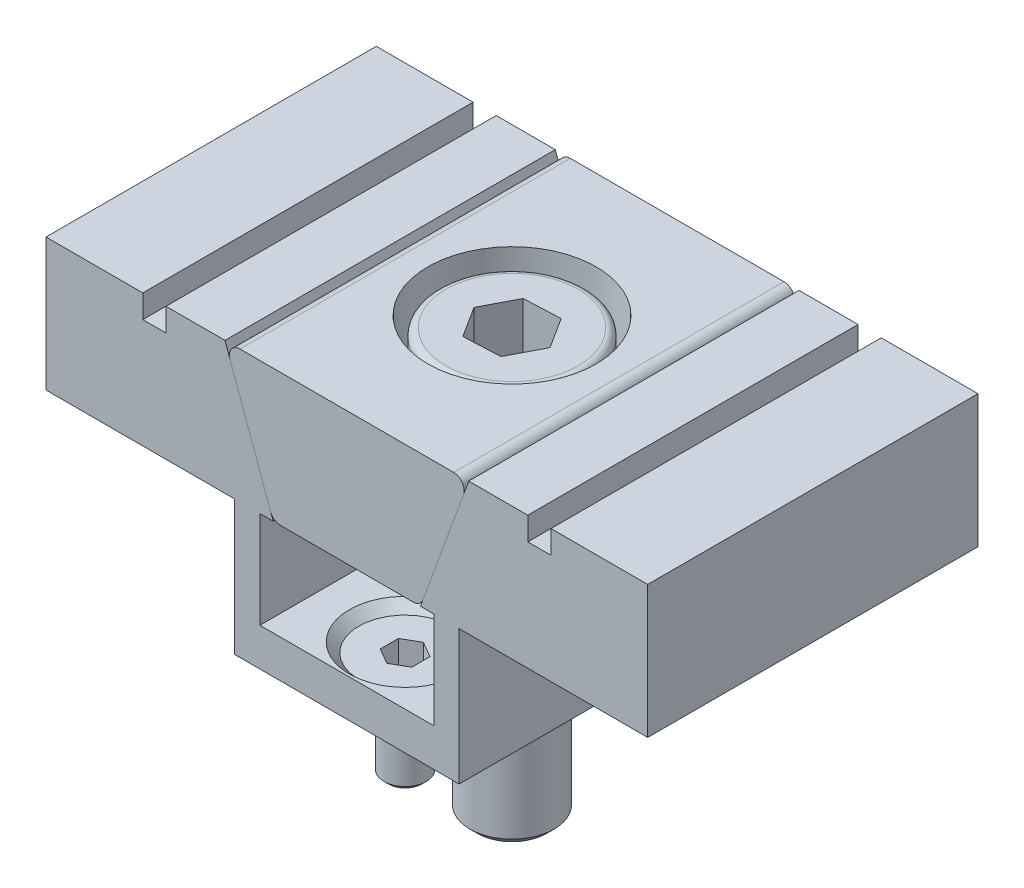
ISO-10303-21;
HEADER;
FILE_DESCRIPTION(('STEP AP214'),'2;1');
FILE_NAME('part.step','',(''),(''),'','','');
FILE_SCHEMA(('AUTOMOTIVE_DESIGN { 1 0 10303 214 1 1 1 1 }'));
ENDSEC;
DATA;
#1=APPLICATION_CONTEXT('core data for automotive mechanical design processes');
#2=APPLICATION_PROTOCOL_DEFINITION('international standard','automotive_design',2000,#1);
#3=PRODUCT_CONTEXT('',#1,'mechanical');
#4=PRODUCT('Part','Part','',(#3));
#5=PRODUCT_RELATED_PRODUCT_CATEGORY('part','',(#4));
#6=PRODUCT_DEFINITION_FORMATION('','',#4);
#7=PRODUCT_DEFINITION_CONTEXT('part definition',#1,'design');
#8=PRODUCT_DEFINITION('design','',#6,#7);
#9=PRODUCT_DEFINITION_SHAPE('','',#8);
#10=(LENGTH_UNIT() NAMED_UNIT(*) SI_UNIT(.MILLI.,.METRE.));
#11=(NAMED_UNIT(*) PLANE_ANGLE_UNIT() SI_UNIT($,.RADIAN.));
#12=(NAMED_UNIT(*) SI_UNIT($,.STERADIAN.) SOLID_ANGLE_UNIT());
#13=UNCERTAINTY_MEASURE_WITH_UNIT(LENGTH_MEASURE(1.E-05),#10,'distance_accuracy_value','');
#14=(GEOMETRIC_REPRESENTATION_CONTEXT(3) GLOBAL_UNCERTAINTY_ASSIGNED_CONTEXT((#13)) GLOBAL_UNIT_ASSIGNED_CONTEXT((#10,
#11,#12)) REPRESENTATION_CONTEXT('',''));
#15=CARTESIAN_POINT('',(0.,0.,0.));
#16=DIRECTION('',(0.,0.,1.));
#17=DIRECTION('',(1.,0.,0.));
#18=AXIS2_PLACEMENT_3D('',#15,#16,#17);
#19=CARTESIAN_POINT('',(0.,-6.55000000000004,4.21397459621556));
#20=DIRECTION('',(0.,1.,0.));
#21=DIRECTION('',(0.,0.,1.));
#22=AXIS2_PLACEMENT_3D('',#19,#20,#21);
#23=PLANE('',#22);
#24=DIRECTION('',(0.866025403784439,0.,0.5));
#25=VECTOR('',#24,1.);
#26=CARTESIAN_POINT('',(-0.75,-6.55000000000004,5.51301270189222));
#27=LINE('',#26,#25);
#28=CARTESIAN_POINT('',(-0.75,-6.55000000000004,5.51301270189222));
#29=VERTEX_POINT('',#28);
#30=CARTESIAN_POINT('',(-0.375,-6.55000000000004,5.72951905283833));
#31=VERTEX_POINT('',#30);
#32=EDGE_CURVE('P0_E174',#29,#31,#27,.T.);
#33=ORIENTED_EDGE('',*,*,#32,.T.);
#34=CARTESIAN_POINT('',(0.,-6.55000000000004,5.08));
#35=DIRECTION('',(0.,1.,0.));
#36=DIRECTION('',(0.,0.,1.));
#37=AXIS2_PLACEMENT_3D('',#34,#35,#36);
#38=CIRCLE('',#37,0.75);
#39=CARTESIAN_POINT('',(-0.75,-6.55000000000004,5.08));
#40=VERTEX_POINT('',#39);
#41=EDGE_CURVE('P0_E11',#31,#40,#38,.F.);
#42=ORIENTED_EDGE('',*,*,#41,.T.);
#43=DIRECTION('',(0.,0.,1.));
#44=VECTOR('',#43,1.);
#45=CARTESIAN_POINT('',(-0.75,-6.55000000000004,4.64698729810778));
#46=LINE('',#45,#44);
#47=EDGE_CURVE('P0_E178',#40,#29,#46,.T.);
#48=ORIENTED_EDGE('',*,*,#47,.T.);
#49=EDGE_LOOP('',(#33,#42,#48));
#50=FACE_BOUND('',#49,.T.);
#51=ADVANCED_FACE('P0_F16',(#50),#23,.T.);
#52=CARTESIAN_POINT('',(-0.75,-6.55000000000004,4.64698729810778));
#53=VERTEX_POINT('',#52);
#54=EDGE_CURVE('P0_E175',#53,#40,#46,.T.);
#55=ORIENTED_EDGE('',*,*,#54,.T.);
#56=CARTESIAN_POINT('',(-0.375,-6.55000000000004,4.43048094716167));
#57=VERTEX_POINT('',#56);
#58=EDGE_CURVE('P0_E25',#40,#57,#38,.F.);
#59=ORIENTED_EDGE('',*,*,#58,.T.);
#60=DIRECTION('',(-0.866025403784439,0.,0.5));
#61=VECTOR('',#60,1.);
#62=CARTESIAN_POINT('',(0.,-6.55000000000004,4.21397459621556));
#63=LINE('',#62,#61);
#64=EDGE_CURVE('P0_E186',#57,#53,#63,.T.);
#65=ORIENTED_EDGE('',*,*,#64,.T.);
#66=EDGE_LOOP('',(#55,#59,#65));
#67=FACE_BOUND('',#66,.T.);
#68=ADVANCED_FACE('P0_F199',(#67),#23,.T.);
#69=CARTESIAN_POINT('',(0.,-6.55000000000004,4.21397459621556));
#70=VERTEX_POINT('',#69);
#71=EDGE_CURVE('P0_E183',#70,#57,#63,.T.);
#72=ORIENTED_EDGE('',*,*,#71,.T.);
#73=CARTESIAN_POINT('',(0.375,-6.55000000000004,4.43048094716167));
#74=VERTEX_POINT('',#73);
#75=EDGE_CURVE('P0_E109',#57,#74,#38,.F.);
#76=ORIENTED_EDGE('',*,*,#75,.T.);
#77=DIRECTION('',(-0.866025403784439,0.,-0.5));
#78=VECTOR('',#77,1.);
#79=CARTESIAN_POINT('',(0.75,-6.55000000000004,4.64698729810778));
#80=LINE('',#79,#78);
#81=EDGE_CURVE('P0_E142',#74,#70,#80,.T.);
#82=ORIENTED_EDGE('',*,*,#81,.T.);
#83=EDGE_LOOP('',(#72,#76,#82));
#84=FACE_BOUND('',#83,.T.);
#85=ADVANCED_FACE('P0_F189',(#84),#23,.T.);
#86=CARTESIAN_POINT('',(0.75,-6.55000000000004,4.64698729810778));
#87=VERTEX_POINT('',#86);
#88=EDGE_CURVE('P0_E108',#87,#74,#80,.T.);
#89=ORIENTED_EDGE('',*,*,#88,.T.);
#90=CARTESIAN_POINT('',(0.75,-6.55000000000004,5.08));
#91=VERTEX_POINT('',#90);
#92=EDGE_CURVE('P0_E95',#74,#91,#38,.F.);
#93=ORIENTED_EDGE('',*,*,#92,.T.);
#94=DIRECTION('',(0.,0.,-1.));
#95=VECTOR('',#94,1.);
#96=CARTESIAN_POINT('',(0.75,-6.55000000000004,5.51301270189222));
#97=LINE('',#96,#95);
#98=EDGE_CURVE('P0_E105',#91,#87,#97,.T.);
#99=ORIENTED_EDGE('',*,*,#98,.T.);
#100=EDGE_LOOP('',(#89,#93,#99));
#101=FACE_BOUND('',#100,.T.);
#102=ADVANCED_FACE('P0_F104',(#101),#23,.T.);
#103=CARTESIAN_POINT('',(0.75,-6.55000000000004,5.51301270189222));
#104=VERTEX_POINT('',#103);
#105=EDGE_CURVE('P0_E114',#104,#91,#97,.T.);
#106=ORIENTED_EDGE('',*,*,#105,.T.);
#107=CARTESIAN_POINT('',(0.,-6.55000000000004,5.08));
#108=DIRECTION('',(0.,-1.,0.));
#109=DIRECTION('',(1.,0.,0.));
#110=AXIS2_PLACEMENT_3D('',#107,#108,#109);
#111=CIRCLE('',#110,0.75);
#112=CARTESIAN_POINT('',(0.375,-6.55000000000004,5.72951905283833));
#113=VERTEX_POINT('',#112);
#114=EDGE_CURVE('P0_E93',#91,#113,#111,.T.);
#115=ORIENTED_EDGE('',*,*,#114,.T.);
#116=DIRECTION('',(0.866025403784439,0.,-0.5));
#117=VECTOR('',#116,1.);
#118=CARTESIAN_POINT('',(0.,-6.55000000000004,5.94602540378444));
#119=LINE('',#118,#117);
#120=EDGE_CURVE('P0_E119',#113,#104,#119,.T.);
#121=ORIENTED_EDGE('',*,*,#120,.T.);
#122=EDGE_LOOP('',(#106,#115,#121));
#123=FACE_BOUND('',#122,.T.);
#124=ADVANCED_FACE('P0_F118',(#123),#23,.T.);
#125=CARTESIAN_POINT('',(0.,-6.55000000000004,5.94602540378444));
#126=VERTEX_POINT('',#125);
#127=EDGE_CURVE('P0_E116',#126,#113,#119,.T.);
#128=ORIENTED_EDGE('',*,*,#127,.T.);
#129=EDGE_CURVE('P0_E20',#113,#31,#38,.F.);
#130=ORIENTED_EDGE('',*,*,#129,.T.);
#131=EDGE_CURVE('P0_E167',#31,#126,#27,.T.);
#132=ORIENTED_EDGE('',*,*,#131,.T.);
#133=EDGE_LOOP('',(#128,#130,#132));
#134=FACE_BOUND('',#133,.T.);
#135=ADVANCED_FACE('P0_F166',(#134),#23,.T.);
#136=CARTESIAN_POINT('',(0.,-10.05,5.08));
#137=DIRECTION('',(0.,1.,0.));
#138=DIRECTION('',(0.,0.,1.));
#139=AXIS2_PLACEMENT_3D('',#136,#137,#138);
#140=CYLINDRICAL_SURFACE('',#139,1.);
#141=CARTESIAN_POINT('',(0.,-9.85000000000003,5.08));
#142=DIRECTION('',(0.,1.,0.));
#143=DIRECTION('',(0.,0.,1.));
#144=AXIS2_PLACEMENT_3D('',#141,#142,#143);
#145=CIRCLE('',#144,1.);
#146=CARTESIAN_POINT('',(0.,-9.85000000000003,6.08));
#147=VERTEX_POINT('',#146);
#148=EDGE_CURVE('P0_E157',#147,#147,#145,.T.);
#149=ORIENTED_EDGE('',*,*,#148,.T.);
#150=EDGE_LOOP('',(#149));
#151=FACE_BOUND('',#150,.T.);
#152=CARTESIAN_POINT('',(0.,-6.25000000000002,5.08));
#153=DIRECTION('',(0.,1.,0.));
#154=DIRECTION('',(-1.,0.,0.));
#155=AXIS2_PLACEMENT_3D('',#152,#153,#154);
#156=CIRCLE('',#155,1.);
#157=CARTESIAN_POINT('',(-1.,-6.25000000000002,5.08));
#158=VERTEX_POINT('',#157);
#159=EDGE_CURVE('P0_E154',#158,#158,#156,.F.);
#160=ORIENTED_EDGE('',*,*,#159,.T.);
#161=EDGE_LOOP('',(#160));
#162=FACE_BOUND('',#161,.T.);
#163=ADVANCED_FACE('P0_F226',(#151,#162),#140,.T.);
#164=CARTESIAN_POINT('',(0.,-10.05,5.08));
#165=DIRECTION('',(0.,1.,0.));
#166=DIRECTION('',(0.,0.,1.));
#167=AXIS2_PLACEMENT_3D('',#164,#165,#166);
#168=PLANE('',#167);
#169=CARTESIAN_POINT('',(0.,-10.05,5.08));
#170=DIRECTION('',(0.,1.,0.));
#171=DIRECTION('',(0.,0.,1.));
#172=AXIS2_PLACEMENT_3D('',#169,#170,#171);
#173=CIRCLE('',#172,0.799999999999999);
#174=CARTESIAN_POINT('',(0.,-10.05,5.88));
#175=VERTEX_POINT('',#174);
#176=EDGE_CURVE('P0_E159',#175,#175,#173,.F.);
#177=ORIENTED_EDGE('',*,*,#176,.T.);
#178=EDGE_LOOP('',(#177));
#179=FACE_BOUND('',#178,.T.);
#180=ADVANCED_FACE('P0_F231',(#179),#168,.F.);
#181=CARTESIAN_POINT('',(0.,-5.05000000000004,5.08));
#182=DIRECTION('',(0.,1.,0.));
#183=DIRECTION('',(-1.,0.,0.));
#184=AXIS2_PLACEMENT_3D('',#181,#182,#183);
#185=CONICAL_SURFACE('',#184,2.2,0.785398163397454);
#186=ORIENTED_EDGE('',*,*,#159,.F.);
#187=EDGE_LOOP('',(#186));
#188=FACE_BOUND('',#187,.T.);
#189=CARTESIAN_POINT('',(0.,-5.05000000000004,5.08));
#190=DIRECTION('',(0.,-1.,0.));
#191=DIRECTION('',(1.,0.,0.));
#192=AXIS2_PLACEMENT_3D('',#189,#190,#191);
#193=CIRCLE('',#192,2.2);
#194=CARTESIAN_POINT('',(2.2,-5.05000000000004,5.08));
#195=VERTEX_POINT('',#194);
#196=EDGE_CURVE('P0_E144',#195,#195,#193,.T.);
#197=ORIENTED_EDGE('',*,*,#196,.T.);
#198=EDGE_LOOP('',(#197));
#199=FACE_BOUND('',#198,.T.);
#200=ADVANCED_FACE('P0_F286',(#188,#199),#185,.T.);
#201=CARTESIAN_POINT('',(0.,-5.05000000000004,5.08));
#202=DIRECTION('',(0.,1.,0.));
#203=DIRECTION('',(0.,0.,1.));
#204=AXIS2_PLACEMENT_3D('',#201,#202,#203);
#205=PLANE('',#204);
#206=DIRECTION('',(-0.866025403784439,0.,-0.5));
#207=VECTOR('',#206,1.);
#208=CARTESIAN_POINT('',(0.75,-5.05000000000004,4.64698729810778));
#209=LINE('',#208,#207);
#210=CARTESIAN_POINT('',(0.75,-5.05000000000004,4.64698729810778));
#211=VERTEX_POINT('',#210);
#212=CARTESIAN_POINT('',(0.,-5.05000000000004,4.21397459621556));
#213=VERTEX_POINT('',#212);
#214=EDGE_CURVE('P0_E38',#211,#213,#209,.T.);
#215=ORIENTED_EDGE('',*,*,#214,.F.);
#216=DIRECTION('',(0.,0.,-1.));
#217=VECTOR('',#216,1.);
#218=CARTESIAN_POINT('',(0.75,-5.05000000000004,5.51301270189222));
#219=LINE('',#218,#217);
#220=CARTESIAN_POINT('',(0.75,-5.05000000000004,5.51301270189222));
#221=VERTEX_POINT('',#220);
#222=EDGE_CURVE('P0_E140',#221,#211,#219,.T.);
#223=ORIENTED_EDGE('',*,*,#222,.F.);
#224=DIRECTION('',(0.866025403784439,0.,-0.5));
#225=VECTOR('',#224,1.);
#226=CARTESIAN_POINT('',(0.,-5.05000000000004,5.94602540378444));
#227=LINE('',#226,#225);
#228=CARTESIAN_POINT('',(0.,-5.05000000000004,5.94602540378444));
#229=VERTEX_POINT('',#228);
#230=EDGE_CURVE('P0_E137',#229,#221,#227,.T.);
#231=ORIENTED_EDGE('',*,*,#230,.F.);
#232=DIRECTION('',(0.866025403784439,0.,0.5));
#233=VECTOR('',#232,1.);
#234=CARTESIAN_POINT('',(-0.75,-5.05000000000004,5.51301270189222));
#235=LINE('',#234,#233);
#236=CARTESIAN_POINT('',(-0.75,-5.05000000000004,5.51301270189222));
#237=VERTEX_POINT('',#236);
#238=EDGE_CURVE('P0_E134',#237,#229,#235,.T.);
#239=ORIENTED_EDGE('',*,*,#238,.F.);
#240=DIRECTION('',(0.,0.,1.));
#241=VECTOR('',#240,1.);
#242=CARTESIAN_POINT('',(-0.75,-5.05000000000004,4.64698729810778));
#243=LINE('',#242,#241);
#244=CARTESIAN_POINT('',(-0.75,-5.05000000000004,4.64698729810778));
#245=VERTEX_POINT('',#244);
#246=EDGE_CURVE('P0_E131',#245,#237,#243,.T.);
#247=ORIENTED_EDGE('',*,*,#246,.F.);
#248=DIRECTION('',(-0.866025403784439,0.,0.5));
#249=VECTOR('',#248,1.);
#250=CARTESIAN_POINT('',(0.,-5.05000000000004,4.21397459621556));
#251=LINE('',#250,#249);
#252=EDGE_CURVE('P0_E128',#213,#245,#251,.T.);
#253=ORIENTED_EDGE('',*,*,#252,.F.);
#254=EDGE_LOOP('',(#215,#223,#231,#239,#247,#253));
#255=FACE_BOUND('',#254,.T.);
#256=ORIENTED_EDGE('',*,*,#196,.F.);
#257=EDGE_LOOP('',(#256));
#258=FACE_BOUND('',#257,.T.);
#259=ADVANCED_FACE('P0_F207',(#255,#258),#205,.T.);
#260=CARTESIAN_POINT('',(0.,-9.85000000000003,5.08));
#261=DIRECTION('',(0.,1.,0.));
#262=DIRECTION('',(0.,0.,1.));
#263=AXIS2_PLACEMENT_3D('',#260,#261,#262);
#264=CONICAL_SURFACE('',#263,1.,0.785398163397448);
#265=ORIENTED_EDGE('',*,*,#176,.F.);
#266=EDGE_LOOP('',(#265));
#267=FACE_BOUND('',#266,.T.);
#268=ORIENTED_EDGE('',*,*,#148,.F.);
#269=EDGE_LOOP('',(#268));
#270=FACE_BOUND('',#269,.T.);
#271=ADVANCED_FACE('P0_F18',(#267,#270),#264,.T.);
#272=CARTESIAN_POINT('',(0.75,-6.55000000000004,4.64698729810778));
#273=DIRECTION('',(0.5,0.,-0.866025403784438));
#274=DIRECTION('',(-0.866025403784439,0.,-0.5));
#275=AXIS2_PLACEMENT_3D('',#272,#273,#274);
#276=PLANE('',#275);
#277=ORIENTED_EDGE('',*,*,#214,.T.);
#278=DIRECTION('',(0.,1.,0.));
#279=VECTOR('',#278,1.);
#280=CARTESIAN_POINT('',(0.,-6.55000000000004,4.21397459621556));
#281=LINE('',#280,#279);
#282=EDGE_CURVE('P0_E121',#70,#213,#281,.T.);
#283=ORIENTED_EDGE('',*,*,#282,.F.);
#284=ORIENTED_EDGE('',*,*,#81,.F.);
#285=ORIENTED_EDGE('',*,*,#88,.F.);
#286=DIRECTION('',(0.,1.,0.));
#287=VECTOR('',#286,1.);
#288=CARTESIAN_POINT('',(0.75,-6.55000000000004,4.64698729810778));
#289=LINE('',#288,#287);
#290=EDGE_CURVE('P0_E115',#87,#211,#289,.T.);
#291=ORIENTED_EDGE('',*,*,#290,.T.);
#292=EDGE_LOOP('',(#277,#283,#284,#285,#291));
#293=FACE_BOUND('',#292,.T.);
#294=ADVANCED_FACE('P0_F191',(#293),#276,.F.);
#295=CARTESIAN_POINT('',(0.75,-6.55000000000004,5.51301270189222));
#296=DIRECTION('',(1.,0.,0.));
#297=DIRECTION('',(0.,0.,-1.));
#298=AXIS2_PLACEMENT_3D('',#295,#296,#297);
#299=PLANE('',#298);
#300=ORIENTED_EDGE('',*,*,#222,.T.);
#301=ORIENTED_EDGE('',*,*,#290,.F.);
#302=ORIENTED_EDGE('',*,*,#98,.F.);
#303=ORIENTED_EDGE('',*,*,#105,.F.);
#304=DIRECTION('',(0.,1.,0.));
#305=VECTOR('',#304,1.);
#306=CARTESIAN_POINT('',(0.75,-6.55000000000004,5.51301270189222));
#307=LINE('',#306,#305);
#308=EDGE_CURVE('P0_E145',#104,#221,#307,.T.);
#309=ORIENTED_EDGE('',*,*,#308,.T.);
#310=EDGE_LOOP('',(#300,#301,#302,#303,#309));
#311=FACE_BOUND('',#310,.T.);
#312=ADVANCED_FACE('P0_F113',(#311),#299,.F.);
#313=CARTESIAN_POINT('',(0.,-6.55000000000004,5.94602540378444));
#314=DIRECTION('',(0.5,0.,0.866025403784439));
#315=DIRECTION('',(0.866025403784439,0.,-0.5));
#316=AXIS2_PLACEMENT_3D('',#313,#314,#315);
#317=PLANE('',#316);
#318=ORIENTED_EDGE('',*,*,#230,.T.);
#319=ORIENTED_EDGE('',*,*,#308,.F.);
#320=ORIENTED_EDGE('',*,*,#120,.F.);
#321=ORIENTED_EDGE('',*,*,#127,.F.);
#322=DIRECTION('',(0.,1.,0.));
#323=VECTOR('',#322,1.);
#324=CARTESIAN_POINT('',(0.,-6.55000000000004,5.94602540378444));
#325=LINE('',#324,#323);
#326=EDGE_CURVE('P0_E147',#126,#229,#325,.T.);
#327=ORIENTED_EDGE('',*,*,#326,.T.);
#328=EDGE_LOOP('',(#318,#319,#320,#321,#327));
#329=FACE_BOUND('',#328,.T.);
#330=ADVANCED_FACE('P0_F210',(#329),#317,.F.);
#331=CARTESIAN_POINT('',(-0.75,-6.55000000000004,5.51301270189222));
#332=DIRECTION('',(-0.5,0.,0.866025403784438));
#333=DIRECTION('',(0.866025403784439,0.,0.5));
#334=AXIS2_PLACEMENT_3D('',#331,#332,#333);
#335=PLANE('',#334);
#336=ORIENTED_EDGE('',*,*,#238,.T.);
#337=ORIENTED_EDGE('',*,*,#326,.F.);
#338=ORIENTED_EDGE('',*,*,#131,.F.);
#339=ORIENTED_EDGE('',*,*,#32,.F.);
#340=DIRECTION('',(0.,1.,0.));
#341=VECTOR('',#340,1.);
#342=CARTESIAN_POINT('',(-0.75,-6.55000000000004,5.51301270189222));
#343=LINE('',#342,#341);
#344=EDGE_CURVE('P0_E149',#29,#237,#343,.T.);
#345=ORIENTED_EDGE('',*,*,#344,.T.);
#346=EDGE_LOOP('',(#336,#337,#338,#339,#345));
#347=FACE_BOUND('',#346,.T.);
#348=ADVANCED_FACE('P0_F173',(#347),#335,.F.);
#349=CARTESIAN_POINT('',(-0.75,-6.55000000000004,4.64698729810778));
#350=DIRECTION('',(-1.,0.,0.));
#351=DIRECTION('',(0.,0.,1.));
#352=AXIS2_PLACEMENT_3D('',#349,#350,#351);
#353=PLANE('',#352);
#354=ORIENTED_EDGE('',*,*,#246,.T.);
#355=ORIENTED_EDGE('',*,*,#344,.F.);
#356=ORIENTED_EDGE('',*,*,#47,.F.);
#357=ORIENTED_EDGE('',*,*,#54,.F.);
#358=DIRECTION('',(0.,1.,0.));
#359=VECTOR('',#358,1.);
#360=CARTESIAN_POINT('',(-0.75,-6.55000000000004,4.64698729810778));
#361=LINE('',#360,#359);
#362=EDGE_CURVE('P0_E122',#53,#245,#361,.T.);
#363=ORIENTED_EDGE('',*,*,#362,.T.);
#364=EDGE_LOOP('',(#354,#355,#356,#357,#363));
#365=FACE_BOUND('',#364,.T.);
#366=ADVANCED_FACE('P0_F201',(#365),#353,.F.);
#367=CARTESIAN_POINT('',(0.,-6.55000000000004,4.21397459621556));
#368=DIRECTION('',(-0.5,0.,-0.866025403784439));
#369=DIRECTION('',(-0.866025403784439,0.,0.5));
#370=AXIS2_PLACEMENT_3D('',#367,#368,#369);
#371=PLANE('',#370);
#372=ORIENTED_EDGE('',*,*,#252,.T.);
#373=ORIENTED_EDGE('',*,*,#362,.F.);
#374=ORIENTED_EDGE('',*,*,#64,.F.);
#375=ORIENTED_EDGE('',*,*,#71,.F.);
#376=ORIENTED_EDGE('',*,*,#282,.T.);
#377=EDGE_LOOP('',(#372,#373,#374,#375,#376));
#378=FACE_BOUND('',#377,.T.);
#379=ADVANCED_FACE('P0_F90',(#378),#371,.F.);
#380=CARTESIAN_POINT('',(0.,-6.55000000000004,5.08));
#381=DIRECTION('',(0.,1.,0.));
#382=DIRECTION('',(-1.,0.,0.));
#383=AXIS2_PLACEMENT_3D('',#380,#381,#382);
#384=CONICAL_SURFACE('',#383,0.75,1.0471975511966);
#385=CARTESIAN_POINT('',(0.,-6.98301270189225,5.08));
#386=VERTEX_POINT('',#385);
#387=VERTEX_LOOP('',#386);
#388=FACE_BOUND('',#387,.T.);
#389=ORIENTED_EDGE('',*,*,#114,.F.);
#390=ORIENTED_EDGE('',*,*,#92,.F.);
#391=ORIENTED_EDGE('',*,*,#75,.F.);
#392=ORIENTED_EDGE('',*,*,#58,.F.);
#393=ORIENTED_EDGE('',*,*,#41,.F.);
#394=ORIENTED_EDGE('',*,*,#129,.F.);
#395=EDGE_LOOP('',(#389,#390,#391,#392,#393,#394));
#396=FACE_BOUND('',#395,.T.);
#397=ADVANCED_FACE('P0_F88',(#388,#396),#384,.F.);
#398=CLOSED_SHELL('',(#51,#68,#85,#102,#124,#135,#163,#180,#200,#259,#271,#294,#312,#330,#348,
#366,#379,#397));
#399=MANIFOLD_SOLID_BREP('P0_B1',#398);
#400=CARTESIAN_POINT('',(0.,1.80000000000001,0.));
#401=DIRECTION('',(0.,-1.,0.));
#402=DIRECTION('',(-0.887264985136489,0.,-0.461260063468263));
#403=AXIS2_PLACEMENT_3D('',#400,#401,#402);
#404=CYLINDRICAL_SURFACE('',#403,2.);
#405=CARTESIAN_POINT('',(0.,-13.85,0.));
#406=DIRECTION('',(0.,1.,0.));
#407=DIRECTION('',(0.887264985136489,0.,0.461260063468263));
#408=AXIS2_PLACEMENT_3D('',#405,#406,#407);
#409=CIRCLE('',#408,2.);
#410=CARTESIAN_POINT('',(1.77452997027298,-13.85,0.922520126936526));
#411=VERTEX_POINT('',#410);
#412=EDGE_CURVE('P1_E24',#411,#411,#409,.T.);
#413=ORIENTED_EDGE('',*,*,#412,.T.);
#414=EDGE_LOOP('',(#413));
#415=FACE_BOUND('',#414,.T.);
#416=CARTESIAN_POINT('',(0.,1.80000000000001,0.));
#417=DIRECTION('',(0.,1.,0.));
#418=DIRECTION('',(0.887264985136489,0.,0.461260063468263));
#419=AXIS2_PLACEMENT_3D('',#416,#417,#418);
#420=CIRCLE('',#419,2.);
#421=CARTESIAN_POINT('',(1.77452997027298,1.80000000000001,0.922520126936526));
#422=VERTEX_POINT('',#421);
#423=EDGE_CURVE('P1_E126',#422,#422,#420,.T.);
#424=ORIENTED_EDGE('',*,*,#423,.F.);
#425=EDGE_LOOP('',(#424));
#426=FACE_BOUND('',#425,.T.);
#427=ADVANCED_FACE('P1_F16',(#415,#426),#404,.T.);
#428=CARTESIAN_POINT('',(0.,-14.2,0.));
#429=DIRECTION('',(0.,1.,0.));
#430=DIRECTION('',(0.887264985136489,0.,0.461260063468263));
#431=AXIS2_PLACEMENT_3D('',#428,#429,#430);
#432=PLANE('',#431);
#433=CARTESIAN_POINT('',(0.,-14.2,0.));
#434=DIRECTION('',(0.,1.,0.));
#435=DIRECTION('',(0.887264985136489,0.,0.461260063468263));
#436=AXIS2_PLACEMENT_3D('',#433,#434,#435);
#437=CIRCLE('',#436,1.65);
#438=CARTESIAN_POINT('',(1.46398722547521,-14.2,0.761079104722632));
#439=VERTEX_POINT('',#438);
#440=EDGE_CURVE('P1_E11',#439,#439,#437,.F.);
#441=ORIENTED_EDGE('',*,*,#440,.T.);
#442=EDGE_LOOP('',(#441));
#443=FACE_BOUND('',#442,.T.);
#444=ADVANCED_FACE('P1_F149',(#443),#432,.F.);
#445=CARTESIAN_POINT('',(0.,1.80000000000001,0.));
#446=DIRECTION('',(0.,1.,0.));
#447=DIRECTION('',(0.887264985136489,0.,0.461260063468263));
#448=AXIS2_PLACEMENT_3D('',#445,#446,#447);
#449=PLANE('',#448);
#450=CARTESIAN_POINT('',(0.,1.80000000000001,0.));
#451=DIRECTION('',(0.,1.,0.));
#452=DIRECTION('',(0.887264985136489,0.,0.461260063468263));
#453=AXIS2_PLACEMENT_3D('',#450,#451,#452);
#454=CIRCLE('',#453,3.5);
#455=CARTESIAN_POINT('',(3.10542744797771,1.80000000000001,1.61441022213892));
#456=VERTEX_POINT('',#455);
#457=EDGE_CURVE('P1_E118',#456,#456,#454,.T.);
#458=ORIENTED_EDGE('',*,*,#457,.F.);
#459=EDGE_LOOP('',(#458));
#460=FACE_BOUND('',#459,.T.);
#461=ORIENTED_EDGE('',*,*,#423,.T.);
#462=EDGE_LOOP('',(#461));
#463=FACE_BOUND('',#462,.T.);
#464=ADVANCED_FACE('P1_F155',(#460,#463),#449,.F.);
#465=CARTESIAN_POINT('',(0.,5.80000000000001,0.));
#466=DIRECTION('',(0.,-1.,0.));
#467=DIRECTION('',(-0.887264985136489,0.,-0.461260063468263));
#468=AXIS2_PLACEMENT_3D('',#465,#466,#467);
#469=CYLINDRICAL_SURFACE('',#468,3.5);
#470=CARTESIAN_POINT('',(0.,5.45000000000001,0.));
#471=DIRECTION('',(0.,1.,0.));
#472=DIRECTION('',(0.887264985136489,0.,0.461260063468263));
#473=AXIS2_PLACEMENT_3D('',#470,#471,#472);
#474=CIRCLE('',#473,3.5);
#475=CARTESIAN_POINT('',(3.10542744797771,5.45000000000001,1.61441022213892));
#476=VERTEX_POINT('',#475);
#477=EDGE_CURVE('P1_E132',#476,#476,#474,.F.);
#478=ORIENTED_EDGE('',*,*,#477,.T.);
#479=EDGE_LOOP('',(#478));
#480=FACE_BOUND('',#479,.T.);
#481=ORIENTED_EDGE('',*,*,#457,.T.);
#482=EDGE_LOOP('',(#481));
#483=FACE_BOUND('',#482,.T.);
#484=ADVANCED_FACE('P1_F159',(#480,#483),#469,.T.);
#485=CARTESIAN_POINT('',(0.,5.80000000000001,0.));
#486=DIRECTION('',(0.,1.,0.));
#487=DIRECTION('',(0.887264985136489,0.,0.461260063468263));
#488=AXIS2_PLACEMENT_3D('',#485,#486,#487);
#489=PLANE('',#488);
#490=CARTESIAN_POINT('',(0.,5.80000000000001,0.));
#491=DIRECTION('',(0.,1.,0.));
#492=DIRECTION('',(0.887264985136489,0.,0.461260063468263));
#493=AXIS2_PLACEMENT_3D('',#490,#491,#492);
#494=CIRCLE('',#493,3.15);
#495=CARTESIAN_POINT('',(2.79488470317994,5.80000000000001,1.45296919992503));
#496=VERTEX_POINT('',#495);
#497=EDGE_CURVE('P1_E129',#496,#496,#494,.T.);
#498=ORIENTED_EDGE('',*,*,#497,.T.);
#499=EDGE_LOOP('',(#498));
#500=FACE_BOUND('',#499,.T.);
#501=DIRECTION('',(-0.999024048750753,0.,0.0441695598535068));
#502=VECTOR('',#501,1.);
#503=CARTESIAN_POINT('',(0.798925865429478,5.80000000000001,-1.53678803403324));
#504=LINE('',#503,#502);
#505=CARTESIAN_POINT('',(0.798925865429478,5.80000000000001,-1.53678803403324));
#506=VERTEX_POINT('',#505);
#507=CARTESIAN_POINT('',(-0.931434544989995,5.80000000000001,-1.46028411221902));
#508=VERTEX_POINT('',#507);
#509=EDGE_CURVE('P1_E31',#506,#508,#504,.T.);
#510=ORIENTED_EDGE('',*,*,#509,.F.);
#511=DIRECTION('',(-0.537763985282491,0.,-0.843095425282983));
#512=VECTOR('',#511,1.);
#513=CARTESIAN_POINT('',(1.73036041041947,5.80000000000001,-0.0765039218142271));
#514=LINE('',#513,#512);
#515=CARTESIAN_POINT('',(1.73036041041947,5.80000000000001,-0.0765039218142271));
#516=VERTEX_POINT('',#515);
#517=EDGE_CURVE('P1_E114',#516,#506,#514,.T.);
#518=ORIENTED_EDGE('',*,*,#517,.F.);
#519=DIRECTION('',(0.461260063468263,0.,-0.887264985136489));
#520=VECTOR('',#519,1.);
#521=CARTESIAN_POINT('',(0.931434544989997,5.80000000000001,1.46028411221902));
#522=LINE('',#521,#520);
#523=CARTESIAN_POINT('',(0.931434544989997,5.80000000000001,1.46028411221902));
#524=VERTEX_POINT('',#523);
#525=EDGE_CURVE('P1_E112',#524,#516,#522,.T.);
#526=ORIENTED_EDGE('',*,*,#525,.F.);
#527=DIRECTION('',(0.999024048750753,0.,-0.0441695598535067));
#528=VECTOR('',#527,1.);
#529=CARTESIAN_POINT('',(-0.798925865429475,5.80000000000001,1.53678803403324));
#530=LINE('',#529,#528);
#531=CARTESIAN_POINT('',(-0.798925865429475,5.80000000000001,1.53678803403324));
#532=VERTEX_POINT('',#531);
#533=EDGE_CURVE('P1_E79',#532,#524,#530,.T.);
#534=ORIENTED_EDGE('',*,*,#533,.F.);
#535=DIRECTION('',(0.537763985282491,0.,0.843095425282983));
#536=VECTOR('',#535,1.);
#537=CARTESIAN_POINT('',(-1.73036041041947,5.80000000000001,0.0765039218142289));
#538=LINE('',#537,#536);
#539=CARTESIAN_POINT('',(-1.73036041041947,5.80000000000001,0.0765039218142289));
#540=VERTEX_POINT('',#539);
#541=EDGE_CURVE('P1_E108',#540,#532,#538,.T.);
#542=ORIENTED_EDGE('',*,*,#541,.F.);
#543=DIRECTION('',(-0.461260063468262,0.,0.88726498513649));
#544=VECTOR('',#543,1.);
#545=CARTESIAN_POINT('',(-0.931434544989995,5.80000000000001,-1.46028411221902));
#546=LINE('',#545,#544);
#547=EDGE_CURVE('P1_E105',#508,#540,#546,.T.);
#548=ORIENTED_EDGE('',*,*,#547,.F.);
#549=EDGE_LOOP('',(#510,#518,#526,#534,#542,#548));
#550=FACE_BOUND('',#549,.T.);
#551=ADVANCED_FACE('P1_F162',(#500,#550),#489,.T.);
#552=CARTESIAN_POINT('',(0.798925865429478,2.80000000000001,-1.53678803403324));
#553=DIRECTION('',(-0.0441695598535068,0.,-0.999024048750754));
#554=DIRECTION('',(-0.999024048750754,0.,0.0441695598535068));
#555=AXIS2_PLACEMENT_3D('',#552,#553,#554);
#556=PLANE('',#555);
#557=ORIENTED_EDGE('',*,*,#509,.T.);
#558=DIRECTION('',(0.,1.,0.));
#559=VECTOR('',#558,1.);
#560=CARTESIAN_POINT('',(-0.931434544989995,2.80000000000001,-1.46028411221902));
#561=LINE('',#560,#559);
#562=CARTESIAN_POINT('',(-0.931434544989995,2.80000000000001,-1.46028411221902));
#563=VERTEX_POINT('',#562);
#564=EDGE_CURVE('P1_E61',#563,#508,#561,.T.);
#565=ORIENTED_EDGE('',*,*,#564,.F.);
#566=DIRECTION('',(-0.999024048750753,0.,0.0441695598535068));
#567=VECTOR('',#566,1.);
#568=CARTESIAN_POINT('',(0.798925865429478,2.80000000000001,-1.53678803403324));
#569=LINE('',#568,#567);
#570=CARTESIAN_POINT('',(0.798925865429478,2.80000000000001,-1.53678803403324));
#571=VERTEX_POINT('',#570);
#572=EDGE_CURVE('P1_E116',#571,#563,#569,.T.);
#573=ORIENTED_EDGE('',*,*,#572,.F.);
#574=DIRECTION('',(0.,1.,0.));
#575=VECTOR('',#574,1.);
#576=CARTESIAN_POINT('',(0.798925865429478,2.80000000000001,-1.53678803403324));
#577=LINE('',#576,#575);
#578=EDGE_CURVE('P1_E39',#571,#506,#577,.T.);
#579=ORIENTED_EDGE('',*,*,#578,.T.);
#580=EDGE_LOOP('',(#557,#565,#573,#579));
#581=FACE_BOUND('',#580,.T.);
#582=ADVANCED_FACE('P1_F169',(#581),#556,.F.);
#583=CARTESIAN_POINT('',(1.73036041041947,2.80000000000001,-0.0765039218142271));
#584=DIRECTION('',(0.843095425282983,0.,-0.53776398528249));
#585=DIRECTION('',(-0.537763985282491,0.,-0.843095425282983));
#586=AXIS2_PLACEMENT_3D('',#583,#584,#585);
#587=PLANE('',#586);
#588=ORIENTED_EDGE('',*,*,#517,.T.);
#589=ORIENTED_EDGE('',*,*,#578,.F.);
#590=DIRECTION('',(-0.537763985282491,0.,-0.843095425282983));
#591=VECTOR('',#590,1.);
#592=CARTESIAN_POINT('',(1.73036041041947,2.80000000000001,-0.0765039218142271));
#593=LINE('',#592,#591);
#594=CARTESIAN_POINT('',(1.73036041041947,2.80000000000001,-0.0765039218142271));
#595=VERTEX_POINT('',#594);
#596=EDGE_CURVE('P1_E91',#595,#571,#593,.T.);
#597=ORIENTED_EDGE('',*,*,#596,.F.);
#598=DIRECTION('',(0.,1.,0.));
#599=VECTOR('',#598,1.);
#600=CARTESIAN_POINT('',(1.73036041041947,2.80000000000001,-0.0765039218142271));
#601=LINE('',#600,#599);
#602=EDGE_CURVE('P1_E83',#595,#516,#601,.T.);
#603=ORIENTED_EDGE('',*,*,#602,.T.);
#604=EDGE_LOOP('',(#588,#589,#597,#603));
#605=FACE_BOUND('',#604,.T.);
#606=ADVANCED_FACE('P1_F173',(#605),#587,.F.);
#607=CARTESIAN_POINT('',(0.931434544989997,2.80000000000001,1.46028411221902));
#608=DIRECTION('',(0.887264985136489,0.,0.461260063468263));
#609=DIRECTION('',(0.461260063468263,0.,-0.887264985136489));
#610=AXIS2_PLACEMENT_3D('',#607,#608,#609);
#611=PLANE('',#610);
#612=ORIENTED_EDGE('',*,*,#525,.T.);
#613=ORIENTED_EDGE('',*,*,#602,.F.);
#614=DIRECTION('',(0.461260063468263,0.,-0.887264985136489));
#615=VECTOR('',#614,1.);
#616=CARTESIAN_POINT('',(0.931434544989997,2.80000000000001,1.46028411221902));
#617=LINE('',#616,#615);
#618=CARTESIAN_POINT('',(0.931434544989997,2.80000000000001,1.46028411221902));
#619=VERTEX_POINT('',#618);
#620=EDGE_CURVE('P1_E87',#619,#595,#617,.T.);
#621=ORIENTED_EDGE('',*,*,#620,.F.);
#622=DIRECTION('',(0.,1.,0.));
#623=VECTOR('',#622,1.);
#624=CARTESIAN_POINT('',(0.931434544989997,2.80000000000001,1.46028411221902));
#625=LINE('',#624,#623);
#626=EDGE_CURVE('P1_E72',#619,#524,#625,.T.);
#627=ORIENTED_EDGE('',*,*,#626,.T.);
#628=EDGE_LOOP('',(#612,#613,#621,#627));
#629=FACE_BOUND('',#628,.T.);
#630=ADVANCED_FACE('P1_F88',(#629),#611,.F.);
#631=CARTESIAN_POINT('',(-0.798925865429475,2.80000000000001,1.53678803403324));
#632=DIRECTION('',(0.0441695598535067,0.,0.999024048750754));
#633=DIRECTION('',(0.999024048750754,0.,-0.0441695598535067));
#634=AXIS2_PLACEMENT_3D('',#631,#632,#633);
#635=PLANE('',#634);
#636=ORIENTED_EDGE('',*,*,#533,.T.);
#637=ORIENTED_EDGE('',*,*,#626,.F.);
#638=DIRECTION('',(0.999024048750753,0.,-0.0441695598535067));
#639=VECTOR('',#638,1.);
#640=CARTESIAN_POINT('',(-0.798925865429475,2.80000000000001,1.53678803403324));
#641=LINE('',#640,#639);
#642=CARTESIAN_POINT('',(-0.798925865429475,2.80000000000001,1.53678803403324));
#643=VERTEX_POINT('',#642);
#644=EDGE_CURVE('P1_E76',#643,#619,#641,.T.);
#645=ORIENTED_EDGE('',*,*,#644,.F.);
#646=DIRECTION('',(0.,1.,0.));
#647=VECTOR('',#646,1.);
#648=CARTESIAN_POINT('',(-0.798925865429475,2.80000000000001,1.53678803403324));
#649=LINE('',#648,#647);
#650=EDGE_CURVE('P1_E84',#643,#532,#649,.T.);
#651=ORIENTED_EDGE('',*,*,#650,.T.);
#652=EDGE_LOOP('',(#636,#637,#645,#651));
#653=FACE_BOUND('',#652,.T.);
#654=ADVANCED_FACE('P1_F74',(#653),#635,.F.);
#655=CARTESIAN_POINT('',(-1.73036041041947,2.80000000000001,0.0765039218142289));
#656=DIRECTION('',(-0.843095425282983,0.,0.53776398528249));
#657=DIRECTION('',(0.537763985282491,0.,0.843095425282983));
#658=AXIS2_PLACEMENT_3D('',#655,#656,#657);
#659=PLANE('',#658);
#660=ORIENTED_EDGE('',*,*,#541,.T.);
#661=ORIENTED_EDGE('',*,*,#650,.F.);
#662=DIRECTION('',(0.537763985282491,0.,0.843095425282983));
#663=VECTOR('',#662,1.);
#664=CARTESIAN_POINT('',(-1.73036041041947,2.80000000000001,0.0765039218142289));
#665=LINE('',#664,#663);
#666=CARTESIAN_POINT('',(-1.73036041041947,2.80000000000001,0.0765039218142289));
#667=VERTEX_POINT('',#666);
#668=EDGE_CURVE('P1_E97',#667,#643,#665,.T.);
#669=ORIENTED_EDGE('',*,*,#668,.F.);
#670=DIRECTION('',(0.,1.,0.));
#671=VECTOR('',#670,1.);
#672=CARTESIAN_POINT('',(-1.73036041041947,2.80000000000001,0.0765039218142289));
#673=LINE('',#672,#671);
#674=EDGE_CURVE('P1_E121',#667,#540,#673,.T.);
#675=ORIENTED_EDGE('',*,*,#674,.T.);
#676=EDGE_LOOP('',(#660,#661,#669,#675));
#677=FACE_BOUND('',#676,.T.);
#678=ADVANCED_FACE('P1_F177',(#677),#659,.F.);
#679=CARTESIAN_POINT('',(-0.931434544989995,2.80000000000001,-1.46028411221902));
#680=DIRECTION('',(-0.88726498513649,0.,-0.461260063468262));
#681=DIRECTION('',(-0.461260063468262,0.,0.88726498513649));
#682=AXIS2_PLACEMENT_3D('',#679,#680,#681);
#683=PLANE('',#682);
#684=ORIENTED_EDGE('',*,*,#547,.T.);
#685=ORIENTED_EDGE('',*,*,#674,.F.);
#686=DIRECTION('',(-0.461260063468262,0.,0.88726498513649));
#687=VECTOR('',#686,1.);
#688=CARTESIAN_POINT('',(-0.931434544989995,2.80000000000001,-1.46028411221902));
#689=LINE('',#688,#687);
#690=EDGE_CURVE('P1_E99',#563,#667,#689,.T.);
#691=ORIENTED_EDGE('',*,*,#690,.F.);
#692=ORIENTED_EDGE('',*,*,#564,.T.);
#693=EDGE_LOOP('',(#684,#685,#691,#692));
#694=FACE_BOUND('',#693,.T.);
#695=ADVANCED_FACE('P1_F174',(#694),#683,.F.);
#696=CARTESIAN_POINT('',(-0.931434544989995,2.80000000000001,-1.46028411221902));
#697=DIRECTION('',(0.,1.,0.));
#698=DIRECTION('',(0.887264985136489,0.,0.461260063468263));
#699=AXIS2_PLACEMENT_3D('',#696,#697,#698);
#700=PLANE('',#699);
#701=ORIENTED_EDGE('',*,*,#572,.T.);
#702=ORIENTED_EDGE('',*,*,#690,.T.);
#703=ORIENTED_EDGE('',*,*,#668,.T.);
#704=ORIENTED_EDGE('',*,*,#644,.T.);
#705=ORIENTED_EDGE('',*,*,#620,.T.);
#706=ORIENTED_EDGE('',*,*,#596,.T.);
#707=EDGE_LOOP('',(#701,#702,#703,#704,#705,#706));
#708=FACE_BOUND('',#707,.T.);
#709=ADVANCED_FACE('P1_F94',(#708),#700,.T.);
#710=CARTESIAN_POINT('',(0.,5.45000000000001,0.));
#711=DIRECTION('',(0.,1.,0.));
#712=DIRECTION('',(0.887264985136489,0.,0.461260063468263));
#713=AXIS2_PLACEMENT_3D('',#710,#711,#712);
#714=TOROIDAL_SURFACE('',#713,3.15,0.35);
#715=ORIENTED_EDGE('',*,*,#477,.F.);
#716=EDGE_LOOP('',(#715));
#717=FACE_BOUND('',#716,.T.);
#718=ORIENTED_EDGE('',*,*,#497,.F.);
#719=EDGE_LOOP('',(#718));
#720=FACE_BOUND('',#719,.T.);
#721=ADVANCED_FACE('P1_F140',(#717,#720),#714,.T.);
#722=CARTESIAN_POINT('',(0.,-13.85,0.));
#723=DIRECTION('',(0.,1.,0.));
#724=DIRECTION('',(0.887264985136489,0.,0.461260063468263));
#725=AXIS2_PLACEMENT_3D('',#722,#723,#724);
#726=CONICAL_SURFACE('',#725,2.,0.785398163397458);
#727=ORIENTED_EDGE('',*,*,#440,.F.);
#728=EDGE_LOOP('',(#727));
#729=FACE_BOUND('',#728,.T.);
#730=ORIENTED_EDGE('',*,*,#412,.F.);
#731=EDGE_LOOP('',(#730));
#732=FACE_BOUND('',#731,.T.);
#733=ADVANCED_FACE('P1_F18',(#729,#732),#726,.T.);
#734=CLOSED_SHELL('',(#427,#444,#464,#484,#551,#582,#606,#630,#654,#678,#695,#709,#721,#733));
#735=MANIFOLD_SOLID_BREP('P1_B1',#734);
#736=CARTESIAN_POINT('',(0.,0.,0.));
#737=DIRECTION('',(0.,1.,0.));
#738=DIRECTION('',(0.,0.,1.));
#739=AXIS2_PLACEMENT_3D('',#736,#737,#738);
#740=CYLINDRICAL_SURFACE('',#739,2.25);
#741=CARTESIAN_POINT('',(0.,0.,0.));
#742=DIRECTION('',(0.,1.,0.));
#743=DIRECTION('',(0.,0.,1.));
#744=AXIS2_PLACEMENT_3D('',#741,#742,#743);
#745=CIRCLE('',#744,2.25);
#746=CARTESIAN_POINT('',(0.,0.,2.25));
#747=VERTEX_POINT('',#746);
#748=EDGE_CURVE('P2_E120',#747,#747,#745,.T.);
#749=ORIENTED_EDGE('',*,*,#748,.F.);
#750=EDGE_LOOP('',(#749));
#751=FACE_BOUND('',#750,.T.);
#752=CARTESIAN_POINT('',(0.,1.8,0.));
#753=DIRECTION('',(0.,1.,0.));
#754=DIRECTION('',(0.,0.,1.));
#755=AXIS2_PLACEMENT_3D('',#752,#753,#754);
#756=CIRCLE('',#755,2.25);
#757=CARTESIAN_POINT('',(0.,1.8,2.25));
#758=VERTEX_POINT('',#757);
#759=EDGE_CURVE('P2_E117',#758,#758,#756,.F.);
#760=ORIENTED_EDGE('',*,*,#759,.F.);
#761=EDGE_LOOP('',(#760));
#762=FACE_BOUND('',#761,.T.);
#763=ADVANCED_FACE('P2_F16',(#751,#762),#740,.F.);
#764=CARTESIAN_POINT('',(-3.5,0.,7.85));
#765=DIRECTION('',(0.939692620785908,0.342020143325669,0.));
#766=DIRECTION('',(-0.342020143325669,0.939692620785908,0.));
#767=AXIS2_PLACEMENT_3D('',#764,#765,#766);
#768=PLANE('',#767);
#769=DIRECTION('',(0.342020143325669,-0.939692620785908,0.));
#770=VECTOR('',#769,1.);
#771=CARTESIAN_POINT('',(-3.5,0.,-7.85));
#772=LINE('',#771,#770);
#773=CARTESIAN_POINT('',(-5.54878478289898,5.62898992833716,-7.85));
#774=VERTEX_POINT('',#773);
#775=CARTESIAN_POINT('',(-3.6197425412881,0.328989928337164,-7.85));
#776=VERTEX_POINT('',#775);
#777=EDGE_CURVE('P2_E113',#774,#776,#772,.T.);
#778=ORIENTED_EDGE('',*,*,#777,.T.);
#779=DIRECTION('',(0.,0.,-1.));
#780=VECTOR('',#779,1.);
#781=CARTESIAN_POINT('',(-3.6197425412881,0.328989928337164,7.85));
#782=LINE('',#781,#780);
#783=CARTESIAN_POINT('',(-3.6197425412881,0.328989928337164,7.85));
#784=VERTEX_POINT('',#783);
#785=EDGE_CURVE('P2_E140',#776,#784,#782,.F.);
#786=ORIENTED_EDGE('',*,*,#785,.T.);
#787=DIRECTION('',(0.342020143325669,-0.939692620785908,0.));
#788=VECTOR('',#787,1.);
#789=CARTESIAN_POINT('',(-3.5,0.,7.85));
#790=LINE('',#789,#788);
#791=CARTESIAN_POINT('',(-5.54878478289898,5.62898992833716,7.85));
#792=VERTEX_POINT('',#791);
#793=EDGE_CURVE('P2_E111',#792,#784,#790,.T.);
#794=ORIENTED_EDGE('',*,*,#793,.F.);
#795=DIRECTION('',(0.,0.,-1.));
#796=VECTOR('',#795,1.);
#797=CARTESIAN_POINT('',(-5.54878478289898,5.62898992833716,7.85));
#798=LINE('',#797,#796);
#799=EDGE_CURVE('P2_E137',#792,#774,#798,.T.);
#800=ORIENTED_EDGE('',*,*,#799,.T.);
#801=EDGE_LOOP('',(#778,#786,#794,#800));
#802=FACE_BOUND('',#801,.T.);
#803=ADVANCED_FACE('P2_F146',(#802),#768,.F.);
#804=CARTESIAN_POINT('',(3.5,0.,7.85));
#805=DIRECTION('',(0.,1.,0.));
#806=DIRECTION('',(0.,0.,1.));
#807=AXIS2_PLACEMENT_3D('',#804,#805,#806);
#808=PLANE('',#807);
#809=ORIENTED_EDGE('',*,*,#748,.T.);
#810=EDGE_LOOP('',(#809));
#811=FACE_BOUND('',#810,.T.);
#812=DIRECTION('',(1.,0.,0.));
#813=VECTOR('',#812,1.);
#814=CARTESIAN_POINT('',(3.5,0.,-7.85));
#815=LINE('',#814,#813);
#816=CARTESIAN_POINT('',(-3.14989623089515,0.,-7.85));
#817=VERTEX_POINT('',#816);
#818=CARTESIAN_POINT('',(3.14989623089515,0.,-7.85));
#819=VERTEX_POINT('',#818);
#820=EDGE_CURVE('P2_E109',#817,#819,#815,.T.);
#821=ORIENTED_EDGE('',*,*,#820,.T.);
#822=DIRECTION('',(0.,0.,-1.));
#823=VECTOR('',#822,1.);
#824=CARTESIAN_POINT('',(3.14989623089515,0.,7.85));
#825=LINE('',#824,#823);
#826=CARTESIAN_POINT('',(3.14989623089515,0.,7.85));
#827=VERTEX_POINT('',#826);
#828=EDGE_CURVE('P2_E87',#819,#827,#825,.F.);
#829=ORIENTED_EDGE('',*,*,#828,.T.);
#830=DIRECTION('',(1.,0.,0.));
#831=VECTOR('',#830,1.);
#832=CARTESIAN_POINT('',(3.5,0.,7.85));
#833=LINE('',#832,#831);
#834=CARTESIAN_POINT('',(-3.14989623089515,0.,7.85));
#835=VERTEX_POINT('',#834);
#836=EDGE_CURVE('P2_E155',#835,#827,#833,.T.);
#837=ORIENTED_EDGE('',*,*,#836,.F.);
#838=DIRECTION('',(0.,0.,-1.));
#839=VECTOR('',#838,1.);
#840=CARTESIAN_POINT('',(-3.14989623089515,0.,7.85));
#841=LINE('',#840,#839);
#842=EDGE_CURVE('P2_E92',#835,#817,#841,.T.);
#843=ORIENTED_EDGE('',*,*,#842,.T.);
#844=EDGE_LOOP('',(#821,#829,#837,#843));
#845=FACE_BOUND('',#844,.T.);
#846=ADVANCED_FACE('P2_F160',(#811,#845),#808,.F.);
#847=CARTESIAN_POINT('',(3.5,0.,7.85));
#848=DIRECTION('',(-0.939692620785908,0.342020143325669,0.));
#849=DIRECTION('',(-0.342020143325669,-0.939692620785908,0.));
#850=AXIS2_PLACEMENT_3D('',#847,#848,#849);
#851=PLANE('',#850);
#852=DIRECTION('',(0.342020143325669,0.939692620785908,0.));
#853=VECTOR('',#852,1.);
#854=CARTESIAN_POINT('',(3.5,0.,7.85));
#855=LINE('',#854,#853);
#856=CARTESIAN_POINT('',(3.6197425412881,0.328989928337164,7.85));
#857=VERTEX_POINT('',#856);
#858=CARTESIAN_POINT('',(5.54878478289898,5.62898992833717,7.85));
#859=VERTEX_POINT('',#858);
#860=EDGE_CURVE('P2_E101',#857,#859,#855,.T.);
#861=ORIENTED_EDGE('',*,*,#860,.F.);
#862=DIRECTION('',(0.,0.,-1.));
#863=VECTOR('',#862,1.);
#864=CARTESIAN_POINT('',(3.6197425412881,0.328989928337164,7.85));
#865=LINE('',#864,#863);
#866=CARTESIAN_POINT('',(3.6197425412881,0.328989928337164,-7.85));
#867=VERTEX_POINT('',#866);
#868=EDGE_CURVE('P2_E86',#857,#867,#865,.T.);
#869=ORIENTED_EDGE('',*,*,#868,.T.);
#870=DIRECTION('',(0.342020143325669,0.939692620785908,0.));
#871=VECTOR('',#870,1.);
#872=CARTESIAN_POINT('',(3.5,0.,-7.85));
#873=LINE('',#872,#871);
#874=CARTESIAN_POINT('',(5.54878478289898,5.62898992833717,-7.85));
#875=VERTEX_POINT('',#874);
#876=EDGE_CURVE('P2_E99',#867,#875,#873,.T.);
#877=ORIENTED_EDGE('',*,*,#876,.T.);
#878=DIRECTION('',(0.,0.,-1.));
#879=VECTOR('',#878,1.);
#880=CARTESIAN_POINT('',(5.54878478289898,5.62898992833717,7.85));
#881=LINE('',#880,#879);
#882=EDGE_CURVE('P2_E103',#875,#859,#881,.F.);
#883=ORIENTED_EDGE('',*,*,#882,.T.);
#884=EDGE_LOOP('',(#861,#869,#877,#883));
#885=FACE_BOUND('',#884,.T.);
#886=ADVANCED_FACE('P2_F98',(#885),#851,.F.);
#887=CARTESIAN_POINT('',(-5.79301247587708,6.3,7.85));
#888=DIRECTION('',(0.,-1.,0.));
#889=DIRECTION('',(0.,0.,-1.));
#890=AXIS2_PLACEMENT_3D('',#887,#888,#889);
#891=PLANE('',#890);
#892=CARTESIAN_POINT('',(0.,6.3,0.));
#893=DIRECTION('',(0.,1.,0.));
#894=DIRECTION('',(0.,0.,1.));
#895=AXIS2_PLACEMENT_3D('',#892,#893,#894);
#896=CIRCLE('',#895,4.);
#897=CARTESIAN_POINT('',(0.,6.3,4.));
#898=VERTEX_POINT('',#897);
#899=EDGE_CURVE('P2_E167',#898,#898,#896,.T.);
#900=ORIENTED_EDGE('',*,*,#899,.F.);
#901=EDGE_LOOP('',(#900));
#902=FACE_BOUND('',#901,.T.);
#903=DIRECTION('',(-1.,0.,0.));
#904=VECTOR('',#903,1.);
#905=CARTESIAN_POINT('',(-5.79301247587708,6.3,7.85));
#906=LINE('',#905,#904);
#907=CARTESIAN_POINT('',(5.07893847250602,6.3,7.85));
#908=VERTEX_POINT('',#907);
#909=CARTESIAN_POINT('',(-5.07893847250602,6.3,7.85));
#910=VERTEX_POINT('',#909);
#911=EDGE_CURVE('P2_E122',#908,#910,#906,.T.);
#912=ORIENTED_EDGE('',*,*,#911,.F.);
#913=DIRECTION('',(0.,0.,-1.));
#914=VECTOR('',#913,1.);
#915=CARTESIAN_POINT('',(5.07893847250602,6.3,7.85));
#916=LINE('',#915,#914);
#917=CARTESIAN_POINT('',(5.07893847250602,6.3,-7.85));
#918=VERTEX_POINT('',#917);
#919=EDGE_CURVE('P2_E11',#908,#918,#916,.T.);
#920=ORIENTED_EDGE('',*,*,#919,.T.);
#921=DIRECTION('',(-1.,0.,0.));
#922=VECTOR('',#921,1.);
#923=CARTESIAN_POINT('',(-5.79301247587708,6.3,-7.85));
#924=LINE('',#923,#922);
#925=CARTESIAN_POINT('',(-5.07893847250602,6.3,-7.85));
#926=VERTEX_POINT('',#925);
#927=EDGE_CURVE('P2_E108',#918,#926,#924,.T.);
#928=ORIENTED_EDGE('',*,*,#927,.T.);
#929=DIRECTION('',(0.,0.,-1.));
#930=VECTOR('',#929,1.);
#931=CARTESIAN_POINT('',(-5.07893847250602,6.3,7.85));
#932=LINE('',#931,#930);
#933=EDGE_CURVE('P2_E24',#926,#910,#932,.F.);
#934=ORIENTED_EDGE('',*,*,#933,.T.);
#935=EDGE_LOOP('',(#912,#920,#928,#934));
#936=FACE_BOUND('',#935,.T.);
#937=ADVANCED_FACE('P2_F182',(#902,#936),#891,.F.);
#938=CARTESIAN_POINT('',(-5.79301247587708,6.3,7.85));
#939=DIRECTION('',(0.,0.,-1.));
#940=DIRECTION('',(-1.,0.,0.));
#941=AXIS2_PLACEMENT_3D('',#938,#939,#940);
#942=PLANE('',#941);
#943=ORIENTED_EDGE('',*,*,#836,.T.);
#944=CARTESIAN_POINT('',(3.14989623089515,0.499999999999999,7.85));
#945=DIRECTION('',(0.,0.,-1.));
#946=DIRECTION('',(-1.,0.,0.));
#947=AXIS2_PLACEMENT_3D('',#944,#945,#946);
#948=CIRCLE('',#947,0.5);
#949=EDGE_CURVE('P2_E135',#827,#857,#948,.F.);
#950=ORIENTED_EDGE('',*,*,#949,.T.);
#951=ORIENTED_EDGE('',*,*,#860,.T.);
#952=CARTESIAN_POINT('',(5.07893847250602,5.8,7.85));
#953=DIRECTION('',(0.,0.,-1.));
#954=DIRECTION('',(-1.,0.,0.));
#955=AXIS2_PLACEMENT_3D('',#952,#953,#954);
#956=CIRCLE('',#955,0.5);
#957=EDGE_CURVE('P2_E37',#859,#908,#956,.F.);
#958=ORIENTED_EDGE('',*,*,#957,.T.);
#959=ORIENTED_EDGE('',*,*,#911,.T.);
#960=CARTESIAN_POINT('',(-5.07893847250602,5.8,7.85));
#961=DIRECTION('',(0.,0.,-1.));
#962=DIRECTION('',(-1.,0.,0.));
#963=AXIS2_PLACEMENT_3D('',#960,#961,#962);
#964=CIRCLE('',#963,0.5);
#965=EDGE_CURVE('P2_E130',#910,#792,#964,.F.);
#966=ORIENTED_EDGE('',*,*,#965,.T.);
#967=ORIENTED_EDGE('',*,*,#793,.T.);
#968=CARTESIAN_POINT('',(-3.14989623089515,0.499999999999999,7.85));
#969=DIRECTION('',(0.,0.,-1.));
#970=DIRECTION('',(-1.,0.,0.));
#971=AXIS2_PLACEMENT_3D('',#968,#969,#970);
#972=CIRCLE('',#971,0.5);
#973=EDGE_CURVE('P2_E133',#784,#835,#972,.F.);
#974=ORIENTED_EDGE('',*,*,#973,.T.);
#975=EDGE_LOOP('',(#943,#950,#951,#958,#959,#966,#967,#974));
#976=FACE_BOUND('',#975,.T.);
#977=ADVANCED_FACE('P2_F152',(#976),#942,.F.);
#978=CARTESIAN_POINT('',(-5.79301247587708,6.3,-7.85));
#979=DIRECTION('',(0.,0.,-1.));
#980=DIRECTION('',(-1.,0.,0.));
#981=AXIS2_PLACEMENT_3D('',#978,#979,#980);
#982=PLANE('',#981);
#983=ORIENTED_EDGE('',*,*,#876,.F.);
#984=CARTESIAN_POINT('',(3.14989623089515,0.499999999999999,-7.85));
#985=DIRECTION('',(0.,0.,-1.));
#986=DIRECTION('',(-1.,0.,0.));
#987=AXIS2_PLACEMENT_3D('',#984,#985,#986);
#988=CIRCLE('',#987,0.5);
#989=EDGE_CURVE('P2_E82',#867,#819,#988,.T.);
#990=ORIENTED_EDGE('',*,*,#989,.T.);
#991=ORIENTED_EDGE('',*,*,#820,.F.);
#992=CARTESIAN_POINT('',(-3.14989623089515,0.499999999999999,-7.85));
#993=DIRECTION('',(0.,0.,-1.));
#994=DIRECTION('',(-1.,0.,0.));
#995=AXIS2_PLACEMENT_3D('',#992,#993,#994);
#996=CIRCLE('',#995,0.5);
#997=EDGE_CURVE('P2_E93',#817,#776,#996,.T.);
#998=ORIENTED_EDGE('',*,*,#997,.T.);
#999=ORIENTED_EDGE('',*,*,#777,.F.);
#1000=CARTESIAN_POINT('',(-5.07893847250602,5.8,-7.85));
#1001=DIRECTION('',(0.,0.,-1.));
#1002=DIRECTION('',(-1.,0.,0.));
#1003=AXIS2_PLACEMENT_3D('',#1000,#1001,#1002);
#1004=CIRCLE('',#1003,0.5);
#1005=EDGE_CURVE('P2_E102',#774,#926,#1004,.T.);
#1006=ORIENTED_EDGE('',*,*,#1005,.T.);
#1007=ORIENTED_EDGE('',*,*,#927,.F.);
#1008=CARTESIAN_POINT('',(5.07893847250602,5.8,-7.85));
#1009=DIRECTION('',(0.,0.,-1.));
#1010=DIRECTION('',(-1.,0.,0.));
#1011=AXIS2_PLACEMENT_3D('',#1008,#1009,#1010);
#1012=CIRCLE('',#1011,0.5);
#1013=EDGE_CURVE('P2_E107',#918,#875,#1012,.T.);
#1014=ORIENTED_EDGE('',*,*,#1013,.T.);
#1015=EDGE_LOOP('',(#983,#990,#991,#998,#999,#1006,#1007,#1014));
#1016=FACE_BOUND('',#1015,.T.);
#1017=ADVANCED_FACE('P2_F105',(#1016),#982,.T.);
#1018=CARTESIAN_POINT('',(0.,1.8,0.));
#1019=DIRECTION('',(0.,1.,0.));
#1020=DIRECTION('',(0.,0.,1.));
#1021=AXIS2_PLACEMENT_3D('',#1018,#1019,#1020);
#1022=PLANE('',#1021);
#1023=CARTESIAN_POINT('',(0.,1.8,0.));
#1024=DIRECTION('',(0.,1.,0.));
#1025=DIRECTION('',(0.,0.,1.));
#1026=AXIS2_PLACEMENT_3D('',#1023,#1024,#1025);
#1027=CIRCLE('',#1026,4.);
#1028=CARTESIAN_POINT('',(0.,1.8,4.));
#1029=VERTEX_POINT('',#1028);
#1030=EDGE_CURVE('P2_E121',#1029,#1029,#1027,.T.);
#1031=ORIENTED_EDGE('',*,*,#1030,.T.);
#1032=EDGE_LOOP('',(#1031));
#1033=FACE_BOUND('',#1032,.T.);
#1034=ORIENTED_EDGE('',*,*,#759,.T.);
#1035=EDGE_LOOP('',(#1034));
#1036=FACE_BOUND('',#1035,.T.);
#1037=ADVANCED_FACE('P2_F173',(#1033,#1036),#1022,.T.);
#1038=CARTESIAN_POINT('',(0.,1.8,0.));
#1039=DIRECTION('',(0.,1.,0.));
#1040=DIRECTION('',(0.,0.,1.));
#1041=AXIS2_PLACEMENT_3D('',#1038,#1039,#1040);
#1042=CYLINDRICAL_SURFACE('',#1041,4.);
#1043=ORIENTED_EDGE('',*,*,#1030,.F.);
#1044=EDGE_LOOP('',(#1043));
#1045=FACE_BOUND('',#1044,.T.);
#1046=ORIENTED_EDGE('',*,*,#899,.T.);
#1047=EDGE_LOOP('',(#1046));
#1048=FACE_BOUND('',#1047,.T.);
#1049=ADVANCED_FACE('P2_F176',(#1045,#1048),#1042,.F.);
#1050=CARTESIAN_POINT('',(3.14989623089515,0.499999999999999,7.85));
#1051=DIRECTION('',(0.,0.,-1.));
#1052=DIRECTION('',(-1.,0.,0.));
#1053=AXIS2_PLACEMENT_3D('',#1050,#1051,#1052);
#1054=CYLINDRICAL_SURFACE('',#1053,0.5);
#1055=ORIENTED_EDGE('',*,*,#949,.F.);
#1056=ORIENTED_EDGE('',*,*,#828,.F.);
#1057=ORIENTED_EDGE('',*,*,#989,.F.);
#1058=ORIENTED_EDGE('',*,*,#868,.F.);
#1059=EDGE_LOOP('',(#1055,#1056,#1057,#1058));
#1060=FACE_BOUND('',#1059,.T.);
#1061=ADVANCED_FACE('P2_F85',(#1060),#1054,.T.);
#1062=CARTESIAN_POINT('',(-3.14989623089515,0.499999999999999,7.85));
#1063=DIRECTION('',(0.,0.,-1.));
#1064=DIRECTION('',(-1.,0.,0.));
#1065=AXIS2_PLACEMENT_3D('',#1062,#1063,#1064);
#1066=CYLINDRICAL_SURFACE('',#1065,0.5);
#1067=ORIENTED_EDGE('',*,*,#973,.F.);
#1068=ORIENTED_EDGE('',*,*,#785,.F.);
#1069=ORIENTED_EDGE('',*,*,#997,.F.);
#1070=ORIENTED_EDGE('',*,*,#842,.F.);
#1071=EDGE_LOOP('',(#1067,#1068,#1069,#1070));
#1072=FACE_BOUND('',#1071,.T.);
#1073=ADVANCED_FACE('P2_F158',(#1072),#1066,.T.);
#1074=CARTESIAN_POINT('',(5.07893847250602,5.8,7.85));
#1075=DIRECTION('',(0.,0.,-1.));
#1076=DIRECTION('',(-1.,0.,0.));
#1077=AXIS2_PLACEMENT_3D('',#1074,#1075,#1076);
#1078=CYLINDRICAL_SURFACE('',#1077,0.5);
#1079=ORIENTED_EDGE('',*,*,#957,.F.);
#1080=ORIENTED_EDGE('',*,*,#882,.F.);
#1081=ORIENTED_EDGE('',*,*,#1013,.F.);
#1082=ORIENTED_EDGE('',*,*,#919,.F.);
#1083=EDGE_LOOP('',(#1079,#1080,#1081,#1082));
#1084=FACE_BOUND('',#1083,.T.);
#1085=ADVANCED_FACE('P2_F187',(#1084),#1078,.T.);
#1086=CARTESIAN_POINT('',(-5.07893847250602,5.8,7.85));
#1087=DIRECTION('',(0.,0.,-1.));
#1088=DIRECTION('',(-1.,0.,0.));
#1089=AXIS2_PLACEMENT_3D('',#1086,#1087,#1088);
#1090=CYLINDRICAL_SURFACE('',#1089,0.5);
#1091=ORIENTED_EDGE('',*,*,#965,.F.);
#1092=ORIENTED_EDGE('',*,*,#933,.F.);
#1093=ORIENTED_EDGE('',*,*,#1005,.F.);
#1094=ORIENTED_EDGE('',*,*,#799,.F.);
#1095=EDGE_LOOP('',(#1091,#1092,#1093,#1094));
#1096=FACE_BOUND('',#1095,.T.);
#1097=ADVANCED_FACE('P2_F18',(#1096),#1090,.T.);
#1098=CLOSED_SHELL('',(#763,#803,#846,#886,#937,#977,#1017,#1037,#1049,#1061,#1073,#1085,#1097));
#1099=MANIFOLD_SOLID_BREP('P2_B1',#1098);
#1100=CARTESIAN_POINT('',(5.79301247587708,6.3,7.85));
#1101=DIRECTION('',(0.,-1.,0.));
#1102=DIRECTION('',(0.,0.,-1.));
#1103=AXIS2_PLACEMENT_3D('',#1100,#1101,#1102);
#1104=PLANE('',#1103);
#1105=DIRECTION('',(-1.,0.,0.));
#1106=VECTOR('',#1105,1.);
#1107=CARTESIAN_POINT('',(5.79301247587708,6.3,-7.85));
#1108=LINE('',#1107,#1106);
#1109=CARTESIAN_POINT('',(14.3,6.3,-7.85));
#1110=VERTEX_POINT('',#1109);
#1111=CARTESIAN_POINT('',(9.7,6.3,-7.85));
#1112=VERTEX_POINT('',#1111);
#1113=EDGE_CURVE('P3_E200',#1110,#1112,#1108,.T.);
#1114=ORIENTED_EDGE('',*,*,#1113,.T.);
#1115=DIRECTION('',(0.,0.,1.));
#1116=VECTOR('',#1115,1.);
#1117=CARTESIAN_POINT('',(9.7,6.3,-7.85));
#1118=LINE('',#1117,#1116);
#1119=CARTESIAN_POINT('',(9.7,6.3,7.85));
#1120=VERTEX_POINT('',#1119);
#1121=EDGE_CURVE('P3_E369',#1112,#1120,#1118,.T.);
#1122=ORIENTED_EDGE('',*,*,#1121,.T.);
#1123=DIRECTION('',(-1.,0.,0.));
#1124=VECTOR('',#1123,1.);
#1125=CARTESIAN_POINT('',(5.79301247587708,6.3,7.85));
#1126=LINE('',#1125,#1124);
#1127=CARTESIAN_POINT('',(14.3,6.3,7.85));
#1128=VERTEX_POINT('',#1127);
#1129=EDGE_CURVE('P3_E371',#1128,#1120,#1126,.T.);
#1130=ORIENTED_EDGE('',*,*,#1129,.F.);
#1131=DIRECTION('',(0.,0.,-1.));
#1132=VECTOR('',#1131,1.);
#1133=CARTESIAN_POINT('',(14.3,6.3,7.85));
#1134=LINE('',#1133,#1132);
#1135=EDGE_CURVE('P3_E263',#1128,#1110,#1134,.T.);
#1136=ORIENTED_EDGE('',*,*,#1135,.T.);
#1137=EDGE_LOOP('',(#1114,#1122,#1130,#1136));
#1138=FACE_BOUND('',#1137,.T.);
#1139=ADVANCED_FACE('P3_F16',(#1138),#1104,.F.);
#1140=CARTESIAN_POINT('',(-5.79301247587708,6.3,7.85));
#1141=DIRECTION('',(0.,-1.,0.));
#1142=DIRECTION('',(0.,0.,-1.));
#1143=AXIS2_PLACEMENT_3D('',#1140,#1141,#1142);
#1144=PLANE('',#1143);
#1145=DIRECTION('',(-1.,0.,0.));
#1146=VECTOR('',#1145,1.);
#1147=CARTESIAN_POINT('',(-5.79301247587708,6.3,7.85));
#1148=LINE('',#1147,#1146);
#1149=CARTESIAN_POINT('',(-9.7,6.3,7.85));
#1150=VERTEX_POINT('',#1149);
#1151=CARTESIAN_POINT('',(-14.3,6.3,7.85));
#1152=VERTEX_POINT('',#1151);
#1153=EDGE_CURVE('P3_E334',#1150,#1152,#1148,.T.);
#1154=ORIENTED_EDGE('',*,*,#1153,.F.);
#1155=DIRECTION('',(0.,0.,1.));
#1156=VECTOR('',#1155,1.);
#1157=CARTESIAN_POINT('',(-9.7,6.3,-7.85));
#1158=LINE('',#1157,#1156);
#1159=CARTESIAN_POINT('',(-9.7,6.3,-7.85));
#1160=VERTEX_POINT('',#1159);
#1161=EDGE_CURVE('P3_E425',#1160,#1150,#1158,.T.);
#1162=ORIENTED_EDGE('',*,*,#1161,.F.);
#1163=DIRECTION('',(-1.,0.,0.));
#1164=VECTOR('',#1163,1.);
#1165=CARTESIAN_POINT('',(-5.79301247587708,6.3,-7.85));
#1166=LINE('',#1165,#1164);
#1167=CARTESIAN_POINT('',(-14.3,6.3,-7.85));
#1168=VERTEX_POINT('',#1167);
#1169=EDGE_CURVE('P3_E221',#1160,#1168,#1166,.T.);
#1170=ORIENTED_EDGE('',*,*,#1169,.T.);
#1171=DIRECTION('',(0.,0.,-1.));
#1172=VECTOR('',#1171,1.);
#1173=CARTESIAN_POINT('',(-14.3,6.3,7.85));
#1174=LINE('',#1173,#1172);
#1175=EDGE_CURVE('P3_E237',#1152,#1168,#1174,.T.);
#1176=ORIENTED_EDGE('',*,*,#1175,.F.);
#1177=EDGE_LOOP('',(#1154,#1162,#1170,#1176));
#1178=FACE_BOUND('',#1177,.T.);
#1179=ADVANCED_FACE('P3_F472',(#1178),#1144,.F.);
#1180=CARTESIAN_POINT('',(-5.335,0.,7.85));
#1181=DIRECTION('',(1.,0.,0.));
#1182=DIRECTION('',(0.,0.,-1.));
#1183=AXIS2_PLACEMENT_3D('',#1180,#1181,#1182);
#1184=PLANE('',#1183);
#1185=DIRECTION('',(0.,-1.,0.));
#1186=VECTOR('',#1185,1.);
#1187=CARTESIAN_POINT('',(-5.335,0.,-7.85));
#1188=LINE('',#1187,#1186);
#1189=CARTESIAN_POINT('',(-5.335,0.,-7.85));
#1190=VERTEX_POINT('',#1189);
#1191=CARTESIAN_POINT('',(-5.335,-6.4,-7.85));
#1192=VERTEX_POINT('',#1191);
#1193=EDGE_CURVE('P3_E282',#1190,#1192,#1188,.T.);
#1194=ORIENTED_EDGE('',*,*,#1193,.T.);
#1195=DIRECTION('',(0.,0.,-1.));
#1196=VECTOR('',#1195,1.);
#1197=CARTESIAN_POINT('',(-5.335,-6.4,7.85));
#1198=LINE('',#1197,#1196);
#1199=CARTESIAN_POINT('',(-5.335,-6.4,7.85));
#1200=VERTEX_POINT('',#1199);
#1201=EDGE_CURVE('P3_E275',#1200,#1192,#1198,.T.);
#1202=ORIENTED_EDGE('',*,*,#1201,.F.);
#1203=DIRECTION('',(0.,-1.,0.));
#1204=VECTOR('',#1203,1.);
#1205=CARTESIAN_POINT('',(-5.335,0.,7.85));
#1206=LINE('',#1205,#1204);
#1207=CARTESIAN_POINT('',(-5.335,0.,7.85));
#1208=VERTEX_POINT('',#1207);
#1209=EDGE_CURVE('P3_E229',#1208,#1200,#1206,.T.);
#1210=ORIENTED_EDGE('',*,*,#1209,.F.);
#1211=DIRECTION('',(0.,0.,-1.));
#1212=VECTOR('',#1211,1.);
#1213=CARTESIAN_POINT('',(-5.335,0.,7.85));
#1214=LINE('',#1213,#1212);
#1215=EDGE_CURVE('P3_E230',#1208,#1190,#1214,.T.);
#1216=ORIENTED_EDGE('',*,*,#1215,.T.);
#1217=EDGE_LOOP('',(#1194,#1202,#1210,#1216));
#1218=FACE_BOUND('',#1217,.T.);
#1219=ADVANCED_FACE('P3_F458',(#1218),#1184,.F.);
#1220=CARTESIAN_POINT('',(-5.335,-6.4,7.85));
#1221=DIRECTION('',(0.,1.,0.));
#1222=DIRECTION('',(0.,0.,1.));
#1223=AXIS2_PLACEMENT_3D('',#1220,#1221,#1222);
#1224=PLANE('',#1223);
#1225=CARTESIAN_POINT('',(0.,-6.4,-5.08));
#1226=DIRECTION('',(0.,-1.,0.));
#1227=DIRECTION('',(0.,0.,-1.));
#1228=AXIS2_PLACEMENT_3D('',#1225,#1226,#1227);
#1229=CIRCLE('',#1228,1.15);
#1230=CARTESIAN_POINT('',(0.,-6.4,-6.23));
#1231=VERTEX_POINT('',#1230);
#1232=EDGE_CURVE('P3_E427',#1231,#1231,#1229,.T.);
#1233=ORIENTED_EDGE('',*,*,#1232,.F.);
#1234=EDGE_LOOP('',(#1233));
#1235=FACE_BOUND('',#1234,.T.);
#1236=CARTESIAN_POINT('',(0.,-6.4,5.08));
#1237=DIRECTION('',(0.,-1.,0.));
#1238=DIRECTION('',(0.,0.,-1.));
#1239=AXIS2_PLACEMENT_3D('',#1236,#1237,#1238);
#1240=CIRCLE('',#1239,1.15);
#1241=CARTESIAN_POINT('',(0.,-6.4,3.93));
#1242=VERTEX_POINT('',#1241);
#1243=EDGE_CURVE('P3_E436',#1242,#1242,#1240,.T.);
#1244=ORIENTED_EDGE('',*,*,#1243,.F.);
#1245=EDGE_LOOP('',(#1244));
#1246=FACE_BOUND('',#1245,.T.);
#1247=CARTESIAN_POINT('',(0.,-6.4,0.));
#1248=DIRECTION('',(0.,-1.,0.));
#1249=DIRECTION('',(0.,0.,-1.));
#1250=AXIS2_PLACEMENT_3D('',#1247,#1248,#1249);
#1251=CIRCLE('',#1250,2.25);
#1252=CARTESIAN_POINT('',(0.,-6.4,-2.25));
#1253=VERTEX_POINT('',#1252);
#1254=EDGE_CURVE('P3_E283',#1253,#1253,#1251,.T.);
#1255=ORIENTED_EDGE('',*,*,#1254,.F.);
#1256=EDGE_LOOP('',(#1255));
#1257=FACE_BOUND('',#1256,.T.);
#1258=DIRECTION('',(1.,0.,0.));
#1259=VECTOR('',#1258,1.);
#1260=CARTESIAN_POINT('',(-5.335,-6.4,-7.85));
#1261=LINE('',#1260,#1259);
#1262=CARTESIAN_POINT('',(5.335,-6.4,-7.85));
#1263=VERTEX_POINT('',#1262);
#1264=EDGE_CURVE('P3_E347',#1192,#1263,#1261,.T.);
#1265=ORIENTED_EDGE('',*,*,#1264,.T.);
#1266=DIRECTION('',(0.,0.,-1.));
#1267=VECTOR('',#1266,1.);
#1268=CARTESIAN_POINT('',(5.335,-6.4,7.85));
#1269=LINE('',#1268,#1267);
#1270=CARTESIAN_POINT('',(5.335,-6.4,7.85));
#1271=VERTEX_POINT('',#1270);
#1272=EDGE_CURVE('P3_E272',#1271,#1263,#1269,.T.);
#1273=ORIENTED_EDGE('',*,*,#1272,.F.);
#1274=DIRECTION('',(1.,0.,0.));
#1275=VECTOR('',#1274,1.);
#1276=CARTESIAN_POINT('',(-5.335,-6.4,7.85));
#1277=LINE('',#1276,#1275);
#1278=EDGE_CURVE('P3_E443',#1200,#1271,#1277,.T.);
#1279=ORIENTED_EDGE('',*,*,#1278,.F.);
#1280=ORIENTED_EDGE('',*,*,#1201,.T.);
#1281=EDGE_LOOP('',(#1265,#1273,#1279,#1280));
#1282=FACE_BOUND('',#1281,.T.);
#1283=ADVANCED_FACE('P3_F455',(#1235,#1246,#1257,#1282),#1224,.F.);
#1284=CARTESIAN_POINT('',(5.335,0.,7.85));
#1285=DIRECTION('',(-1.,0.,0.));
#1286=DIRECTION('',(0.,0.,1.));
#1287=AXIS2_PLACEMENT_3D('',#1284,#1285,#1286);
#1288=PLANE('',#1287);
#1289=DIRECTION('',(0.,1.,0.));
#1290=VECTOR('',#1289,1.);
#1291=CARTESIAN_POINT('',(5.335,0.,-7.85));
#1292=LINE('',#1291,#1290);
#1293=CARTESIAN_POINT('',(5.335,0.,-7.85));
#1294=VERTEX_POINT('',#1293);
#1295=EDGE_CURVE('P3_E349',#1263,#1294,#1292,.T.);
#1296=ORIENTED_EDGE('',*,*,#1295,.T.);
#1297=DIRECTION('',(0.,0.,-1.));
#1298=VECTOR('',#1297,1.);
#1299=CARTESIAN_POINT('',(5.335,0.,7.85));
#1300=LINE('',#1299,#1298);
#1301=CARTESIAN_POINT('',(5.335,0.,7.85));
#1302=VERTEX_POINT('',#1301);
#1303=EDGE_CURVE('P3_E269',#1302,#1294,#1300,.T.);
#1304=ORIENTED_EDGE('',*,*,#1303,.F.);
#1305=DIRECTION('',(0.,1.,0.));
#1306=VECTOR('',#1305,1.);
#1307=CARTESIAN_POINT('',(5.335,0.,7.85));
#1308=LINE('',#1307,#1306);
#1309=EDGE_CURVE('P3_E445',#1271,#1302,#1308,.T.);
#1310=ORIENTED_EDGE('',*,*,#1309,.F.);
#1311=ORIENTED_EDGE('',*,*,#1272,.T.);
#1312=EDGE_LOOP('',(#1296,#1304,#1310,#1311));
#1313=FACE_BOUND('',#1312,.T.);
#1314=ADVANCED_FACE('P3_F450',(#1313),#1288,.F.);
#1315=CARTESIAN_POINT('',(5.335,0.,7.85));
#1316=DIRECTION('',(0.,1.,0.));
#1317=DIRECTION('',(-1.,0.,0.));
#1318=AXIS2_PLACEMENT_3D('',#1315,#1316,#1317);
#1319=PLANE('',#1318);
#1320=DIRECTION('',(1.,0.,0.));
#1321=VECTOR('',#1320,1.);
#1322=CARTESIAN_POINT('',(5.335,0.,-7.85));
#1323=LINE('',#1322,#1321);
#1324=CARTESIAN_POINT('',(14.3,0.,-7.85));
#1325=VERTEX_POINT('',#1324);
#1326=EDGE_CURVE('P3_E204',#1294,#1325,#1323,.T.);
#1327=ORIENTED_EDGE('',*,*,#1326,.T.);
#1328=DIRECTION('',(0.,0.,-1.));
#1329=VECTOR('',#1328,1.);
#1330=CARTESIAN_POINT('',(14.3,0.,7.85));
#1331=LINE('',#1330,#1329);
#1332=CARTESIAN_POINT('',(14.3,0.,7.85));
#1333=VERTEX_POINT('',#1332);
#1334=EDGE_CURVE('P3_E266',#1333,#1325,#1331,.T.);
#1335=ORIENTED_EDGE('',*,*,#1334,.F.);
#1336=DIRECTION('',(1.,0.,0.));
#1337=VECTOR('',#1336,1.);
#1338=CARTESIAN_POINT('',(5.335,0.,7.85));
#1339=LINE('',#1338,#1337);
#1340=EDGE_CURVE('P3_E446',#1302,#1333,#1339,.T.);
#1341=ORIENTED_EDGE('',*,*,#1340,.F.);
#1342=ORIENTED_EDGE('',*,*,#1303,.T.);
#1343=EDGE_LOOP('',(#1327,#1335,#1341,#1342));
#1344=FACE_BOUND('',#1343,.T.);
#1345=ADVANCED_FACE('P3_F353',(#1344),#1319,.F.);
#1346=CARTESIAN_POINT('',(14.3,0.,7.85));
#1347=DIRECTION('',(-1.,0.,0.));
#1348=DIRECTION('',(0.,0.,1.));
#1349=AXIS2_PLACEMENT_3D('',#1346,#1347,#1348);
#1350=PLANE('',#1349);
#1351=DIRECTION('',(0.,1.,0.));
#1352=VECTOR('',#1351,1.);
#1353=CARTESIAN_POINT('',(14.3,0.,-7.85));
#1354=LINE('',#1353,#1352);
#1355=EDGE_CURVE('P3_E201',#1325,#1110,#1354,.T.);
#1356=ORIENTED_EDGE('',*,*,#1355,.T.);
#1357=ORIENTED_EDGE('',*,*,#1135,.F.);
#1358=DIRECTION('',(0.,1.,0.));
#1359=VECTOR('',#1358,1.);
#1360=CARTESIAN_POINT('',(14.3,0.,7.85));
#1361=LINE('',#1360,#1359);
#1362=EDGE_CURVE('P3_E362',#1333,#1128,#1361,.T.);
#1363=ORIENTED_EDGE('',*,*,#1362,.F.);
#1364=ORIENTED_EDGE('',*,*,#1334,.T.);
#1365=EDGE_LOOP('',(#1356,#1357,#1363,#1364));
#1366=FACE_BOUND('',#1365,.T.);
#1367=ADVANCED_FACE('P3_F360',(#1366),#1350,.F.);
#1368=CARTESIAN_POINT('',(8.6,6.3,7.85));
#1369=VERTEX_POINT('',#1368);
#1370=CARTESIAN_POINT('',(5.79301247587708,6.3,7.85));
#1371=VERTEX_POINT('',#1370);
#1372=EDGE_CURVE('P3_E193',#1369,#1371,#1126,.T.);
#1373=ORIENTED_EDGE('',*,*,#1372,.F.);
#1374=DIRECTION('',(0.,0.,1.));
#1375=VECTOR('',#1374,1.);
#1376=CARTESIAN_POINT('',(8.6,6.3,-7.85));
#1377=LINE('',#1376,#1375);
#1378=CARTESIAN_POINT('',(8.6,6.3,-7.85));
#1379=VERTEX_POINT('',#1378);
#1380=EDGE_CURVE('P3_E180',#1379,#1369,#1377,.T.);
#1381=ORIENTED_EDGE('',*,*,#1380,.F.);
#1382=CARTESIAN_POINT('',(5.79301247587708,6.3,-7.85));
#1383=VERTEX_POINT('',#1382);
#1384=EDGE_CURVE('P3_E191',#1379,#1383,#1108,.T.);
#1385=ORIENTED_EDGE('',*,*,#1384,.T.);
#1386=DIRECTION('',(0.,0.,-1.));
#1387=VECTOR('',#1386,1.);
#1388=CARTESIAN_POINT('',(5.79301247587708,6.3,7.85));
#1389=LINE('',#1388,#1387);
#1390=EDGE_CURVE('P3_E261',#1371,#1383,#1389,.T.);
#1391=ORIENTED_EDGE('',*,*,#1390,.F.);
#1392=EDGE_LOOP('',(#1373,#1381,#1385,#1391));
#1393=FACE_BOUND('',#1392,.T.);
#1394=ADVANCED_FACE('P3_F189',(#1393),#1104,.F.);
#1395=CARTESIAN_POINT('',(5.79301247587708,6.3,7.85));
#1396=DIRECTION('',(0.939692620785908,-0.34202014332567,0.));
#1397=DIRECTION('',(0.34202014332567,0.939692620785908,0.));
#1398=AXIS2_PLACEMENT_3D('',#1395,#1396,#1397);
#1399=PLANE('',#1398);
#1400=DIRECTION('',(-0.34202014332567,-0.939692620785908,0.));
#1401=VECTOR('',#1400,1.);
#1402=CARTESIAN_POINT('',(5.79301247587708,6.3,-7.85));
#1403=LINE('',#1402,#1401);
#1404=CARTESIAN_POINT('',(3.5,0.,-7.85));
#1405=VERTEX_POINT('',#1404);
#1406=EDGE_CURVE('P3_E199',#1383,#1405,#1403,.T.);
#1407=ORIENTED_EDGE('',*,*,#1406,.T.);
#1408=DIRECTION('',(0.,0.,-1.));
#1409=VECTOR('',#1408,1.);
#1410=CARTESIAN_POINT('',(3.5,0.,7.85));
#1411=LINE('',#1410,#1409);
#1412=CARTESIAN_POINT('',(3.5,0.,7.85));
#1413=VERTEX_POINT('',#1412);
#1414=EDGE_CURVE('P3_E258',#1413,#1405,#1411,.T.);
#1415=ORIENTED_EDGE('',*,*,#1414,.F.);
#1416=DIRECTION('',(-0.34202014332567,-0.939692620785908,0.));
#1417=VECTOR('',#1416,1.);
#1418=CARTESIAN_POINT('',(5.79301247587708,6.3,7.85));
#1419=LINE('',#1418,#1417);
#1420=EDGE_CURVE('P3_E373',#1371,#1413,#1419,.T.);
#1421=ORIENTED_EDGE('',*,*,#1420,.F.);
#1422=ORIENTED_EDGE('',*,*,#1390,.T.);
#1423=EDGE_LOOP('',(#1407,#1415,#1421,#1422));
#1424=FACE_BOUND('',#1423,.T.);
#1425=ADVANCED_FACE('P3_F394',(#1424),#1399,.F.);
#1426=CARTESIAN_POINT('',(3.5,0.,7.85));
#1427=DIRECTION('',(0.,1.,0.));
#1428=DIRECTION('',(-1.,0.,0.));
#1429=AXIS2_PLACEMENT_3D('',#1426,#1427,#1428);
#1430=PLANE('',#1429);
#1431=DIRECTION('',(1.,0.,0.));
#1432=VECTOR('',#1431,1.);
#1433=CARTESIAN_POINT('',(3.5,0.,-7.85));
#1434=LINE('',#1433,#1432);
#1435=CARTESIAN_POINT('',(4.135,0.,-7.85));
#1436=VERTEX_POINT('',#1435);
#1437=EDGE_CURVE('P3_E209',#1405,#1436,#1434,.T.);
#1438=ORIENTED_EDGE('',*,*,#1437,.T.);
#1439=DIRECTION('',(0.,0.,-1.));
#1440=VECTOR('',#1439,1.);
#1441=CARTESIAN_POINT('',(4.135,0.,7.85));
#1442=LINE('',#1441,#1440);
#1443=CARTESIAN_POINT('',(4.135,0.,7.85));
#1444=VERTEX_POINT('',#1443);
#1445=EDGE_CURVE('P3_E255',#1444,#1436,#1442,.T.);
#1446=ORIENTED_EDGE('',*,*,#1445,.F.);
#1447=DIRECTION('',(1.,0.,0.));
#1448=VECTOR('',#1447,1.);
#1449=CARTESIAN_POINT('',(3.5,0.,7.85));
#1450=LINE('',#1449,#1448);
#1451=EDGE_CURVE('P3_E375',#1413,#1444,#1450,.T.);
#1452=ORIENTED_EDGE('',*,*,#1451,.F.);
#1453=ORIENTED_EDGE('',*,*,#1414,.T.);
#1454=EDGE_LOOP('',(#1438,#1446,#1452,#1453));
#1455=FACE_BOUND('',#1454,.T.);
#1456=ADVANCED_FACE('P3_F390',(#1455),#1430,.F.);
#1457=CARTESIAN_POINT('',(4.135,0.,7.85));
#1458=DIRECTION('',(1.,0.,0.));
#1459=DIRECTION('',(0.,0.,-1.));
#1460=AXIS2_PLACEMENT_3D('',#1457,#1458,#1459);
#1461=PLANE('',#1460);
#1462=DIRECTION('',(0.,-1.,0.));
#1463=VECTOR('',#1462,1.);
#1464=CARTESIAN_POINT('',(4.135,0.,-7.85));
#1465=LINE('',#1464,#1463);
#1466=CARTESIAN_POINT('',(4.135,-4.6,-7.85));
#1467=VERTEX_POINT('',#1466);
#1468=EDGE_CURVE('P3_E211',#1436,#1467,#1465,.T.);
#1469=ORIENTED_EDGE('',*,*,#1468,.T.);
#1470=DIRECTION('',(0.,0.,-1.));
#1471=VECTOR('',#1470,1.);
#1472=CARTESIAN_POINT('',(4.135,-4.6,7.85));
#1473=LINE('',#1472,#1471);
#1474=CARTESIAN_POINT('',(4.135,-4.6,7.85));
#1475=VERTEX_POINT('',#1474);
#1476=EDGE_CURVE('P3_E252',#1475,#1467,#1473,.T.);
#1477=ORIENTED_EDGE('',*,*,#1476,.F.);
#1478=DIRECTION('',(0.,-1.,0.));
#1479=VECTOR('',#1478,1.);
#1480=CARTESIAN_POINT('',(4.135,0.,7.85));
#1481=LINE('',#1480,#1479);
#1482=EDGE_CURVE('P3_E381',#1444,#1475,#1481,.T.);
#1483=ORIENTED_EDGE('',*,*,#1482,.F.);
#1484=ORIENTED_EDGE('',*,*,#1445,.T.);
#1485=EDGE_LOOP('',(#1469,#1477,#1483,#1484));
#1486=FACE_BOUND('',#1485,.T.);
#1487=ADVANCED_FACE('P3_F303',(#1486),#1461,.F.);
#1488=CARTESIAN_POINT('',(-4.135,-4.6,7.85));
#1489=DIRECTION('',(0.,-1.,0.));
#1490=DIRECTION('',(0.,0.,-1.));
#1491=AXIS2_PLACEMENT_3D('',#1488,#1489,#1490);
#1492=PLANE('',#1491);
#1493=CARTESIAN_POINT('',(0.,-4.6,5.08));
#1494=DIRECTION('',(0.,-1.,0.));
#1495=DIRECTION('',(0.,0.,-1.));
#1496=AXIS2_PLACEMENT_3D('',#1493,#1494,#1495);
#1497=CIRCLE('',#1496,2.65);
#1498=CARTESIAN_POINT('',(0.,-4.6,2.43));
#1499=VERTEX_POINT('',#1498);
#1500=EDGE_CURVE('P3_E286',#1499,#1499,#1497,.T.);
#1501=ORIENTED_EDGE('',*,*,#1500,.T.);
#1502=EDGE_LOOP('',(#1501));
#1503=FACE_BOUND('',#1502,.T.);
#1504=CARTESIAN_POINT('',(0.,-4.6,-5.08));
#1505=DIRECTION('',(0.,-1.,0.));
#1506=DIRECTION('',(0.,0.,-1.));
#1507=AXIS2_PLACEMENT_3D('',#1504,#1505,#1506);
#1508=CIRCLE('',#1507,2.65);
#1509=CARTESIAN_POINT('',(0.,-4.6,-7.73));
#1510=VERTEX_POINT('',#1509);
#1511=EDGE_CURVE('P3_E278',#1510,#1510,#1508,.T.);
#1512=ORIENTED_EDGE('',*,*,#1511,.T.);
#1513=EDGE_LOOP('',(#1512));
#1514=FACE_BOUND('',#1513,.T.);
#1515=CARTESIAN_POINT('',(0.,-4.6,0.));
#1516=DIRECTION('',(0.,-1.,0.));
#1517=DIRECTION('',(0.,0.,-1.));
#1518=AXIS2_PLACEMENT_3D('',#1515,#1516,#1517);
#1519=CIRCLE('',#1518,2.25);
#1520=CARTESIAN_POINT('',(0.,-4.6,-2.25));
#1521=VERTEX_POINT('',#1520);
#1522=EDGE_CURVE('P3_E279',#1521,#1521,#1519,.T.);
#1523=ORIENTED_EDGE('',*,*,#1522,.T.);
#1524=EDGE_LOOP('',(#1523));
#1525=FACE_BOUND('',#1524,.T.);
#1526=DIRECTION('',(-1.,0.,0.));
#1527=VECTOR('',#1526,1.);
#1528=CARTESIAN_POINT('',(-4.135,-4.6,-7.85));
#1529=LINE('',#1528,#1527);
#1530=CARTESIAN_POINT('',(-4.135,-4.6,-7.85));
#1531=VERTEX_POINT('',#1530);
#1532=EDGE_CURVE('P3_E213',#1467,#1531,#1529,.T.);
#1533=ORIENTED_EDGE('',*,*,#1532,.T.);
#1534=DIRECTION('',(0.,0.,-1.));
#1535=VECTOR('',#1534,1.);
#1536=CARTESIAN_POINT('',(-4.135,-4.6,7.85));
#1537=LINE('',#1536,#1535);
#1538=CARTESIAN_POINT('',(-4.135,-4.6,7.85));
#1539=VERTEX_POINT('',#1538);
#1540=EDGE_CURVE('P3_E249',#1539,#1531,#1537,.T.);
#1541=ORIENTED_EDGE('',*,*,#1540,.F.);
#1542=DIRECTION('',(-1.,0.,0.));
#1543=VECTOR('',#1542,1.);
#1544=CARTESIAN_POINT('',(-4.135,-4.6,7.85));
#1545=LINE('',#1544,#1543);
#1546=EDGE_CURVE('P3_E383',#1475,#1539,#1545,.T.);
#1547=ORIENTED_EDGE('',*,*,#1546,.F.);
#1548=ORIENTED_EDGE('',*,*,#1476,.T.);
#1549=EDGE_LOOP('',(#1533,#1541,#1547,#1548));
#1550=FACE_BOUND('',#1549,.T.);
#1551=ADVANCED_FACE('P3_F299',(#1503,#1514,#1525,#1550),#1492,.F.);
#1552=CARTESIAN_POINT('',(-4.135,0.,7.85));
#1553=DIRECTION('',(-1.,0.,0.));
#1554=DIRECTION('',(0.,0.,1.));
#1555=AXIS2_PLACEMENT_3D('',#1552,#1553,#1554);
#1556=PLANE('',#1555);
#1557=DIRECTION('',(0.,1.,0.));
#1558=VECTOR('',#1557,1.);
#1559=CARTESIAN_POINT('',(-4.135,0.,-7.85));
#1560=LINE('',#1559,#1558);
#1561=CARTESIAN_POINT('',(-4.135,0.,-7.85));
#1562=VERTEX_POINT('',#1561);
#1563=EDGE_CURVE('P3_E215',#1531,#1562,#1560,.T.);
#1564=ORIENTED_EDGE('',*,*,#1563,.T.);
#1565=DIRECTION('',(0.,0.,-1.));
#1566=VECTOR('',#1565,1.);
#1567=CARTESIAN_POINT('',(-4.135,0.,7.85));
#1568=LINE('',#1567,#1566);
#1569=CARTESIAN_POINT('',(-4.135,0.,7.85));
#1570=VERTEX_POINT('',#1569);
#1571=EDGE_CURVE('P3_E246',#1570,#1562,#1568,.T.);
#1572=ORIENTED_EDGE('',*,*,#1571,.F.);
#1573=DIRECTION('',(0.,1.,0.));
#1574=VECTOR('',#1573,1.);
#1575=CARTESIAN_POINT('',(-4.135,0.,7.85));
#1576=LINE('',#1575,#1574);
#1577=EDGE_CURVE('P3_E318',#1539,#1570,#1576,.T.);
#1578=ORIENTED_EDGE('',*,*,#1577,.F.);
#1579=ORIENTED_EDGE('',*,*,#1540,.T.);
#1580=EDGE_LOOP('',(#1564,#1572,#1578,#1579));
#1581=FACE_BOUND('',#1580,.T.);
#1582=ADVANCED_FACE('P3_F302',(#1581),#1556,.F.);
#1583=CARTESIAN_POINT('',(-3.5,0.,7.85));
#1584=DIRECTION('',(0.,1.,0.));
#1585=DIRECTION('',(-1.,0.,0.));
#1586=AXIS2_PLACEMENT_3D('',#1583,#1584,#1585);
#1587=PLANE('',#1586);
#1588=DIRECTION('',(1.,0.,0.));
#1589=VECTOR('',#1588,1.);
#1590=CARTESIAN_POINT('',(-3.5,0.,-7.85));
#1591=LINE('',#1590,#1589);
#1592=CARTESIAN_POINT('',(-3.5,0.,-7.85));
#1593=VERTEX_POINT('',#1592);
#1594=EDGE_CURVE('P3_E217',#1562,#1593,#1591,.T.);
#1595=ORIENTED_EDGE('',*,*,#1594,.T.);
#1596=DIRECTION('',(0.,0.,-1.));
#1597=VECTOR('',#1596,1.);
#1598=CARTESIAN_POINT('',(-3.5,0.,7.85));
#1599=LINE('',#1598,#1597);
#1600=CARTESIAN_POINT('',(-3.5,0.,7.85));
#1601=VERTEX_POINT('',#1600);
#1602=EDGE_CURVE('P3_E243',#1601,#1593,#1599,.T.);
#1603=ORIENTED_EDGE('',*,*,#1602,.F.);
#1604=DIRECTION('',(1.,0.,0.));
#1605=VECTOR('',#1604,1.);
#1606=CARTESIAN_POINT('',(-3.5,0.,7.85));
#1607=LINE('',#1606,#1605);
#1608=EDGE_CURVE('P3_E335',#1570,#1601,#1607,.T.);
#1609=ORIENTED_EDGE('',*,*,#1608,.F.);
#1610=ORIENTED_EDGE('',*,*,#1571,.T.);
#1611=EDGE_LOOP('',(#1595,#1603,#1609,#1610));
#1612=FACE_BOUND('',#1611,.T.);
#1613=ADVANCED_FACE('P3_F324',(#1612),#1587,.F.);
#1614=CARTESIAN_POINT('',(-5.79301247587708,6.3,7.85));
#1615=DIRECTION('',(-0.939692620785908,-0.34202014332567,0.));
#1616=DIRECTION('',(0.34202014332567,-0.939692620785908,0.));
#1617=AXIS2_PLACEMENT_3D('',#1614,#1615,#1616);
#1618=PLANE('',#1617);
#1619=DIRECTION('',(-0.34202014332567,0.939692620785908,0.));
#1620=VECTOR('',#1619,1.);
#1621=CARTESIAN_POINT('',(-5.79301247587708,6.3,-7.85));
#1622=LINE('',#1621,#1620);
#1623=CARTESIAN_POINT('',(-5.79301247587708,6.3,-7.85));
#1624=VERTEX_POINT('',#1623);
#1625=EDGE_CURVE('P3_E219',#1593,#1624,#1622,.T.);
#1626=ORIENTED_EDGE('',*,*,#1625,.T.);
#1627=DIRECTION('',(0.,0.,-1.));
#1628=VECTOR('',#1627,1.);
#1629=CARTESIAN_POINT('',(-5.79301247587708,6.3,7.85));
#1630=LINE('',#1629,#1628);
#1631=CARTESIAN_POINT('',(-5.79301247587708,6.3,7.85));
#1632=VERTEX_POINT('',#1631);
#1633=EDGE_CURVE('P3_E240',#1632,#1624,#1630,.T.);
#1634=ORIENTED_EDGE('',*,*,#1633,.F.);
#1635=DIRECTION('',(-0.34202014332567,0.939692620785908,0.));
#1636=VECTOR('',#1635,1.);
#1637=CARTESIAN_POINT('',(-5.79301247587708,6.3,7.85));
#1638=LINE('',#1637,#1636);
#1639=EDGE_CURVE('P3_E330',#1601,#1632,#1638,.T.);
#1640=ORIENTED_EDGE('',*,*,#1639,.F.);
#1641=ORIENTED_EDGE('',*,*,#1602,.T.);
#1642=EDGE_LOOP('',(#1626,#1634,#1640,#1641));
#1643=FACE_BOUND('',#1642,.T.);
#1644=ADVANCED_FACE('P3_F328',(#1643),#1618,.F.);
#1645=CARTESIAN_POINT('',(-8.6,6.3,-7.85));
#1646=VERTEX_POINT('',#1645);
#1647=EDGE_CURVE('P3_E222',#1624,#1646,#1166,.T.);
#1648=ORIENTED_EDGE('',*,*,#1647,.T.);
#1649=DIRECTION('',(0.,0.,1.));
#1650=VECTOR('',#1649,1.);
#1651=CARTESIAN_POINT('',(-8.6,6.3,-7.85));
#1652=LINE('',#1651,#1650);
#1653=CARTESIAN_POINT('',(-8.6,6.3,7.85));
#1654=VERTEX_POINT('',#1653);
#1655=EDGE_CURVE('P3_E428',#1646,#1654,#1652,.T.);
#1656=ORIENTED_EDGE('',*,*,#1655,.T.);
#1657=EDGE_CURVE('P3_E337',#1632,#1654,#1148,.T.);
#1658=ORIENTED_EDGE('',*,*,#1657,.F.);
#1659=ORIENTED_EDGE('',*,*,#1633,.T.);
#1660=EDGE_LOOP('',(#1648,#1656,#1658,#1659));
#1661=FACE_BOUND('',#1660,.T.);
#1662=ADVANCED_FACE('P3_F483',(#1661),#1144,.F.);
#1663=CARTESIAN_POINT('',(-14.3,0.,7.85));
#1664=DIRECTION('',(1.,0.,0.));
#1665=DIRECTION('',(0.,0.,-1.));
#1666=AXIS2_PLACEMENT_3D('',#1663,#1664,#1665);
#1667=PLANE('',#1666);
#1668=DIRECTION('',(0.,-1.,0.));
#1669=VECTOR('',#1668,1.);
#1670=CARTESIAN_POINT('',(-14.3,0.,-7.85));
#1671=LINE('',#1670,#1669);
#1672=CARTESIAN_POINT('',(-14.3,0.,-7.85));
#1673=VERTEX_POINT('',#1672);
#1674=EDGE_CURVE('P3_E225',#1168,#1673,#1671,.T.);
#1675=ORIENTED_EDGE('',*,*,#1674,.T.);
#1676=DIRECTION('',(0.,0.,-1.));
#1677=VECTOR('',#1676,1.);
#1678=CARTESIAN_POINT('',(-14.3,0.,7.85));
#1679=LINE('',#1678,#1677);
#1680=CARTESIAN_POINT('',(-14.3,0.,7.85));
#1681=VERTEX_POINT('',#1680);
#1682=EDGE_CURVE('P3_E233',#1681,#1673,#1679,.T.);
#1683=ORIENTED_EDGE('',*,*,#1682,.F.);
#1684=DIRECTION('',(0.,-1.,0.));
#1685=VECTOR('',#1684,1.);
#1686=CARTESIAN_POINT('',(-14.3,0.,7.85));
#1687=LINE('',#1686,#1685);
#1688=EDGE_CURVE('P3_E342',#1152,#1681,#1687,.T.);
#1689=ORIENTED_EDGE('',*,*,#1688,.F.);
#1690=ORIENTED_EDGE('',*,*,#1175,.T.);
#1691=EDGE_LOOP('',(#1675,#1683,#1689,#1690));
#1692=FACE_BOUND('',#1691,.T.);
#1693=ADVANCED_FACE('P3_F467',(#1692),#1667,.F.);
#1694=CARTESIAN_POINT('',(-5.335,0.,7.85));
#1695=DIRECTION('',(0.,1.,0.));
#1696=DIRECTION('',(-1.,0.,0.));
#1697=AXIS2_PLACEMENT_3D('',#1694,#1695,#1696);
#1698=PLANE('',#1697);
#1699=DIRECTION('',(1.,0.,0.));
#1700=VECTOR('',#1699,1.);
#1701=CARTESIAN_POINT('',(-5.335,0.,-7.85));
#1702=LINE('',#1701,#1700);
#1703=EDGE_CURVE('P3_E227',#1673,#1190,#1702,.T.);
#1704=ORIENTED_EDGE('',*,*,#1703,.T.);
#1705=ORIENTED_EDGE('',*,*,#1215,.F.);
#1706=DIRECTION('',(1.,0.,0.));
#1707=VECTOR('',#1706,1.);
#1708=CARTESIAN_POINT('',(-5.335,0.,7.85));
#1709=LINE('',#1708,#1707);
#1710=EDGE_CURVE('P3_E234',#1681,#1208,#1709,.T.);
#1711=ORIENTED_EDGE('',*,*,#1710,.F.);
#1712=ORIENTED_EDGE('',*,*,#1682,.T.);
#1713=EDGE_LOOP('',(#1704,#1705,#1711,#1712));
#1714=FACE_BOUND('',#1713,.T.);
#1715=ADVANCED_FACE('P3_F462',(#1714),#1698,.F.);
#1716=CARTESIAN_POINT('',(-5.335,-6.4,7.85));
#1717=DIRECTION('',(0.,0.,1.));
#1718=DIRECTION('',(1.,0.,0.));
#1719=AXIS2_PLACEMENT_3D('',#1716,#1717,#1718);
#1720=PLANE('',#1719);
#1721=DIRECTION('',(0.,1.,0.));
#1722=VECTOR('',#1721,1.);
#1723=CARTESIAN_POINT('',(9.7,6.3,7.85));
#1724=LINE('',#1723,#1722);
#1725=CARTESIAN_POINT('',(9.7,5.2,7.85));
#1726=VERTEX_POINT('',#1725);
#1727=EDGE_CURVE('P3_E185',#1726,#1120,#1724,.T.);
#1728=ORIENTED_EDGE('',*,*,#1727,.F.);
#1729=DIRECTION('',(1.,0.,0.));
#1730=VECTOR('',#1729,1.);
#1731=CARTESIAN_POINT('',(9.7,5.2,7.85));
#1732=LINE('',#1731,#1730);
#1733=CARTESIAN_POINT('',(8.6,5.2,7.85));
#1734=VERTEX_POINT('',#1733);
#1735=EDGE_CURVE('P3_E398',#1734,#1726,#1732,.T.);
#1736=ORIENTED_EDGE('',*,*,#1735,.F.);
#1737=DIRECTION('',(0.,-1.,0.));
#1738=VECTOR('',#1737,1.);
#1739=CARTESIAN_POINT('',(8.6,6.3,7.85));
#1740=LINE('',#1739,#1738);
#1741=EDGE_CURVE('P3_E396',#1369,#1734,#1740,.T.);
#1742=ORIENTED_EDGE('',*,*,#1741,.F.);
#1743=ORIENTED_EDGE('',*,*,#1372,.T.);
#1744=ORIENTED_EDGE('',*,*,#1420,.T.);
#1745=ORIENTED_EDGE('',*,*,#1451,.T.);
#1746=ORIENTED_EDGE('',*,*,#1482,.T.);
#1747=ORIENTED_EDGE('',*,*,#1546,.T.);
#1748=ORIENTED_EDGE('',*,*,#1577,.T.);
#1749=ORIENTED_EDGE('',*,*,#1608,.T.);
#1750=ORIENTED_EDGE('',*,*,#1639,.T.);
#1751=ORIENTED_EDGE('',*,*,#1657,.T.);
#1752=DIRECTION('',(0.,1.,0.));
#1753=VECTOR('',#1752,1.);
#1754=CARTESIAN_POINT('',(-8.6,6.3,7.85));
#1755=LINE('',#1754,#1753);
#1756=CARTESIAN_POINT('',(-8.6,5.2,7.85));
#1757=VERTEX_POINT('',#1756);
#1758=EDGE_CURVE('P3_E414',#1757,#1654,#1755,.T.);
#1759=ORIENTED_EDGE('',*,*,#1758,.F.);
#1760=DIRECTION('',(1.,0.,0.));
#1761=VECTOR('',#1760,1.);
#1762=CARTESIAN_POINT('',(-9.7,5.2,7.85));
#1763=LINE('',#1762,#1761);
#1764=CARTESIAN_POINT('',(-9.7,5.2,7.85));
#1765=VERTEX_POINT('',#1764);
#1766=EDGE_CURVE('P3_E421',#1765,#1757,#1763,.T.);
#1767=ORIENTED_EDGE('',*,*,#1766,.F.);
#1768=DIRECTION('',(0.,-1.,0.));
#1769=VECTOR('',#1768,1.);
#1770=CARTESIAN_POINT('',(-9.7,6.3,7.85));
#1771=LINE('',#1770,#1769);
#1772=EDGE_CURVE('P3_E406',#1150,#1765,#1771,.T.);
#1773=ORIENTED_EDGE('',*,*,#1772,.F.);
#1774=ORIENTED_EDGE('',*,*,#1153,.T.);
#1775=ORIENTED_EDGE('',*,*,#1688,.T.);
#1776=ORIENTED_EDGE('',*,*,#1710,.T.);
#1777=ORIENTED_EDGE('',*,*,#1209,.T.);
#1778=ORIENTED_EDGE('',*,*,#1278,.T.);
#1779=ORIENTED_EDGE('',*,*,#1309,.T.);
#1780=ORIENTED_EDGE('',*,*,#1340,.T.);
#1781=ORIENTED_EDGE('',*,*,#1362,.T.);
#1782=ORIENTED_EDGE('',*,*,#1129,.T.);
#1783=EDGE_LOOP('',(#1728,#1736,#1742,#1743,#1744,#1745,#1746,#1747,#1748,#1749,#1750,#1751,
#1759,#1767,#1773,#1774,#1775,#1776,#1777,#1778,#1779,#1780,#1781,#1782));
#1784=FACE_BOUND('',#1783,.T.);
#1785=ADVANCED_FACE('P3_F384',(#1784),#1720,.T.);
#1786=CARTESIAN_POINT('',(-5.335,-6.4,-7.85));
#1787=DIRECTION('',(0.,0.,1.));
#1788=DIRECTION('',(1.,0.,0.));
#1789=AXIS2_PLACEMENT_3D('',#1786,#1787,#1788);
#1790=PLANE('',#1789);
#1791=DIRECTION('',(1.,0.,0.));
#1792=VECTOR('',#1791,1.);
#1793=CARTESIAN_POINT('',(9.7,5.2,-7.85));
#1794=LINE('',#1793,#1792);
#1795=CARTESIAN_POINT('',(8.6,5.2,-7.85));
#1796=VERTEX_POINT('',#1795);
#1797=CARTESIAN_POINT('',(9.7,5.2,-7.85));
#1798=VERTEX_POINT('',#1797);
#1799=EDGE_CURVE('P3_E31',#1796,#1798,#1794,.T.);
#1800=ORIENTED_EDGE('',*,*,#1799,.T.);
#1801=DIRECTION('',(0.,1.,0.));
#1802=VECTOR('',#1801,1.);
#1803=CARTESIAN_POINT('',(9.7,6.3,-7.85));
#1804=LINE('',#1803,#1802);
#1805=EDGE_CURVE('P3_E194',#1798,#1112,#1804,.T.);
#1806=ORIENTED_EDGE('',*,*,#1805,.T.);
#1807=ORIENTED_EDGE('',*,*,#1113,.F.);
#1808=ORIENTED_EDGE('',*,*,#1355,.F.);
#1809=ORIENTED_EDGE('',*,*,#1326,.F.);
#1810=ORIENTED_EDGE('',*,*,#1295,.F.);
#1811=ORIENTED_EDGE('',*,*,#1264,.F.);
#1812=ORIENTED_EDGE('',*,*,#1193,.F.);
#1813=ORIENTED_EDGE('',*,*,#1703,.F.);
#1814=ORIENTED_EDGE('',*,*,#1674,.F.);
#1815=ORIENTED_EDGE('',*,*,#1169,.F.);
#1816=DIRECTION('',(0.,-1.,0.));
#1817=VECTOR('',#1816,1.);
#1818=CARTESIAN_POINT('',(-9.7,6.3,-7.85));
#1819=LINE('',#1818,#1817);
#1820=CARTESIAN_POINT('',(-9.7,5.2,-7.85));
#1821=VERTEX_POINT('',#1820);
#1822=EDGE_CURVE('P3_E410',#1160,#1821,#1819,.T.);
#1823=ORIENTED_EDGE('',*,*,#1822,.T.);
#1824=DIRECTION('',(1.,0.,0.));
#1825=VECTOR('',#1824,1.);
#1826=CARTESIAN_POINT('',(-9.7,5.2,-7.85));
#1827=LINE('',#1826,#1825);
#1828=CARTESIAN_POINT('',(-8.6,5.2,-7.85));
#1829=VERTEX_POINT('',#1828);
#1830=EDGE_CURVE('P3_E413',#1821,#1829,#1827,.T.);
#1831=ORIENTED_EDGE('',*,*,#1830,.T.);
#1832=DIRECTION('',(0.,1.,0.));
#1833=VECTOR('',#1832,1.);
#1834=CARTESIAN_POINT('',(-8.6,6.3,-7.85));
#1835=LINE('',#1834,#1833);
#1836=EDGE_CURVE('P3_E39',#1829,#1646,#1835,.T.);
#1837=ORIENTED_EDGE('',*,*,#1836,.T.);
#1838=ORIENTED_EDGE('',*,*,#1647,.F.);
#1839=ORIENTED_EDGE('',*,*,#1625,.F.);
#1840=ORIENTED_EDGE('',*,*,#1594,.F.);
#1841=ORIENTED_EDGE('',*,*,#1563,.F.);
#1842=ORIENTED_EDGE('',*,*,#1532,.F.);
#1843=ORIENTED_EDGE('',*,*,#1468,.F.);
#1844=ORIENTED_EDGE('',*,*,#1437,.F.);
#1845=ORIENTED_EDGE('',*,*,#1406,.F.);
#1846=ORIENTED_EDGE('',*,*,#1384,.F.);
#1847=DIRECTION('',(0.,-1.,0.));
#1848=VECTOR('',#1847,1.);
#1849=CARTESIAN_POINT('',(8.6,6.3,-7.85));
#1850=LINE('',#1849,#1848);
#1851=EDGE_CURVE('P3_E176',#1379,#1796,#1850,.T.);
#1852=ORIENTED_EDGE('',*,*,#1851,.T.);
#1853=EDGE_LOOP('',(#1800,#1806,#1807,#1808,#1809,#1810,#1811,#1812,#1813,#1814,#1815,#1823,
#1831,#1837,#1838,#1839,#1840,#1841,#1842,#1843,#1844,#1845,#1846,#1852));
#1854=FACE_BOUND('',#1853,.T.);
#1855=ADVANCED_FACE('P3_F197',(#1854),#1790,.F.);
#1856=CARTESIAN_POINT('',(0.,6.3,0.));
#1857=DIRECTION('',(0.,-1.,0.));
#1858=DIRECTION('',(0.,0.,-1.));
#1859=AXIS2_PLACEMENT_3D('',#1856,#1857,#1858);
#1860=CYLINDRICAL_SURFACE('',#1859,2.25);
#1861=ORIENTED_EDGE('',*,*,#1254,.T.);
#1862=EDGE_LOOP('',(#1861));
#1863=FACE_BOUND('',#1862,.T.);
#1864=ORIENTED_EDGE('',*,*,#1522,.F.);
#1865=EDGE_LOOP('',(#1864));
#1866=FACE_BOUND('',#1865,.T.);
#1867=ADVANCED_FACE('P3_F650',(#1863,#1866),#1860,.F.);
#1868=CARTESIAN_POINT('',(0.,6.3,5.08));
#1869=DIRECTION('',(0.,-1.,0.));
#1870=DIRECTION('',(0.,0.,-1.));
#1871=AXIS2_PLACEMENT_3D('',#1868,#1869,#1870);
#1872=CYLINDRICAL_SURFACE('',#1871,1.15);
#1873=CARTESIAN_POINT('',(0.,-6.10000000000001,5.08));
#1874=DIRECTION('',(0.,-1.,0.));
#1875=DIRECTION('',(0.,0.,-1.));
#1876=AXIS2_PLACEMENT_3D('',#1873,#1874,#1875);
#1877=CIRCLE('',#1876,1.15);
#1878=CARTESIAN_POINT('',(0.,-6.10000000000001,3.93));
#1879=VERTEX_POINT('',#1878);
#1880=EDGE_CURVE('P3_E24',#1879,#1879,#1877,.F.);
#1881=ORIENTED_EDGE('',*,*,#1880,.T.);
#1882=EDGE_LOOP('',(#1881));
#1883=FACE_BOUND('',#1882,.T.);
#1884=ORIENTED_EDGE('',*,*,#1243,.T.);
#1885=EDGE_LOOP('',(#1884));
#1886=FACE_BOUND('',#1885,.T.);
#1887=ADVANCED_FACE('P3_F291',(#1883,#1886),#1872,.F.);
#1888=CARTESIAN_POINT('',(0.,6.3,-5.08));
#1889=DIRECTION('',(0.,-1.,0.));
#1890=DIRECTION('',(0.,0.,-1.));
#1891=AXIS2_PLACEMENT_3D('',#1888,#1889,#1890);
#1892=CYLINDRICAL_SURFACE('',#1891,1.15);
#1893=CARTESIAN_POINT('',(0.,-6.10000000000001,-5.08));
#1894=DIRECTION('',(0.,-1.,0.));
#1895=DIRECTION('',(0.,0.,-1.));
#1896=AXIS2_PLACEMENT_3D('',#1893,#1894,#1895);
#1897=CIRCLE('',#1896,1.15);
#1898=CARTESIAN_POINT('',(0.,-6.10000000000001,-6.23));
#1899=VERTEX_POINT('',#1898);
#1900=EDGE_CURVE('P3_E11',#1899,#1899,#1897,.F.);
#1901=ORIENTED_EDGE('',*,*,#1900,.T.);
#1902=EDGE_LOOP('',(#1901));
#1903=FACE_BOUND('',#1902,.T.);
#1904=ORIENTED_EDGE('',*,*,#1232,.T.);
#1905=EDGE_LOOP('',(#1904));
#1906=FACE_BOUND('',#1905,.T.);
#1907=ADVANCED_FACE('P3_F494',(#1903,#1906),#1892,.F.);
#1908=CARTESIAN_POINT('',(-9.7,6.3,-7.85));
#1909=DIRECTION('',(-1.,0.,0.));
#1910=DIRECTION('',(0.,0.,1.));
#1911=AXIS2_PLACEMENT_3D('',#1908,#1909,#1910);
#1912=PLANE('',#1911);
#1913=ORIENTED_EDGE('',*,*,#1772,.T.);
#1914=DIRECTION('',(0.,0.,1.));
#1915=VECTOR('',#1914,1.);
#1916=CARTESIAN_POINT('',(-9.7,5.2,-7.85));
#1917=LINE('',#1916,#1915);
#1918=EDGE_CURVE('P3_E418',#1821,#1765,#1917,.T.);
#1919=ORIENTED_EDGE('',*,*,#1918,.F.);
#1920=ORIENTED_EDGE('',*,*,#1822,.F.);
#1921=ORIENTED_EDGE('',*,*,#1161,.T.);
#1922=EDGE_LOOP('',(#1913,#1919,#1920,#1921));
#1923=FACE_BOUND('',#1922,.T.);
#1924=ADVANCED_FACE('P3_F476',(#1923),#1912,.F.);
#1925=CARTESIAN_POINT('',(-8.6,6.3,-7.85));
#1926=DIRECTION('',(1.,0.,0.));
#1927=DIRECTION('',(0.,0.,-1.));
#1928=AXIS2_PLACEMENT_3D('',#1925,#1926,#1927);
#1929=PLANE('',#1928);
#1930=ORIENTED_EDGE('',*,*,#1758,.T.);
#1931=ORIENTED_EDGE('',*,*,#1655,.F.);
#1932=ORIENTED_EDGE('',*,*,#1836,.F.);
#1933=DIRECTION('',(0.,0.,1.));
#1934=VECTOR('',#1933,1.);
#1935=CARTESIAN_POINT('',(-8.6,5.2,-7.85));
#1936=LINE('',#1935,#1934);
#1937=EDGE_CURVE('P3_E431',#1829,#1757,#1936,.T.);
#1938=ORIENTED_EDGE('',*,*,#1937,.T.);
#1939=EDGE_LOOP('',(#1930,#1931,#1932,#1938));
#1940=FACE_BOUND('',#1939,.T.);
#1941=ADVANCED_FACE('P3_F484',(#1940),#1929,.F.);
#1942=CARTESIAN_POINT('',(-9.7,5.2,-7.85));
#1943=DIRECTION('',(0.,-1.,0.));
#1944=DIRECTION('',(0.,0.,-1.));
#1945=AXIS2_PLACEMENT_3D('',#1942,#1943,#1944);
#1946=PLANE('',#1945);
#1947=ORIENTED_EDGE('',*,*,#1766,.T.);
#1948=ORIENTED_EDGE('',*,*,#1937,.F.);
#1949=ORIENTED_EDGE('',*,*,#1830,.F.);
#1950=ORIENTED_EDGE('',*,*,#1918,.T.);
#1951=EDGE_LOOP('',(#1947,#1948,#1949,#1950));
#1952=FACE_BOUND('',#1951,.T.);
#1953=ADVANCED_FACE('P3_F480',(#1952),#1946,.F.);
#1954=CARTESIAN_POINT('',(9.7,6.3,-7.85));
#1955=DIRECTION('',(1.,0.,0.));
#1956=DIRECTION('',(0.,0.,-1.));
#1957=AXIS2_PLACEMENT_3D('',#1954,#1955,#1956);
#1958=PLANE('',#1957);
#1959=ORIENTED_EDGE('',*,*,#1727,.T.);
#1960=ORIENTED_EDGE('',*,*,#1121,.F.);
#1961=ORIENTED_EDGE('',*,*,#1805,.F.);
#1962=DIRECTION('',(0.,0.,1.));
#1963=VECTOR('',#1962,1.);
#1964=CARTESIAN_POINT('',(9.7,5.2,-7.85));
#1965=LINE('',#1964,#1963);
#1966=EDGE_CURVE('P3_E407',#1798,#1726,#1965,.T.);
#1967=ORIENTED_EDGE('',*,*,#1966,.T.);
#1968=EDGE_LOOP('',(#1959,#1960,#1961,#1967));
#1969=FACE_BOUND('',#1968,.T.);
#1970=ADVANCED_FACE('P3_F492',(#1969),#1958,.F.);
#1971=CARTESIAN_POINT('',(9.7,5.2,-7.85));
#1972=DIRECTION('',(0.,-1.,0.));
#1973=DIRECTION('',(0.,0.,-1.));
#1974=AXIS2_PLACEMENT_3D('',#1971,#1972,#1973);
#1975=PLANE('',#1974);
#1976=ORIENTED_EDGE('',*,*,#1735,.T.);
#1977=ORIENTED_EDGE('',*,*,#1966,.F.);
#1978=ORIENTED_EDGE('',*,*,#1799,.F.);
#1979=DIRECTION('',(0.,0.,1.));
#1980=VECTOR('',#1979,1.);
#1981=CARTESIAN_POINT('',(8.6,5.2,-7.85));
#1982=LINE('',#1981,#1980);
#1983=EDGE_CURVE('P3_E182',#1796,#1734,#1982,.T.);
#1984=ORIENTED_EDGE('',*,*,#1983,.T.);
#1985=EDGE_LOOP('',(#1976,#1977,#1978,#1984));
#1986=FACE_BOUND('',#1985,.T.);
#1987=ADVANCED_FACE('P3_F701',(#1986),#1975,.F.);
#1988=CARTESIAN_POINT('',(8.6,6.3,-7.85));
#1989=DIRECTION('',(-1.,0.,0.));
#1990=DIRECTION('',(0.,0.,1.));
#1991=AXIS2_PLACEMENT_3D('',#1988,#1989,#1990);
#1992=PLANE('',#1991);
#1993=ORIENTED_EDGE('',*,*,#1741,.T.);
#1994=ORIENTED_EDGE('',*,*,#1983,.F.);
#1995=ORIENTED_EDGE('',*,*,#1851,.F.);
#1996=ORIENTED_EDGE('',*,*,#1380,.T.);
#1997=EDGE_LOOP('',(#1993,#1994,#1995,#1996));
#1998=FACE_BOUND('',#1997,.T.);
#1999=ADVANCED_FACE('P3_F179',(#1998),#1992,.F.);
#2000=CARTESIAN_POINT('',(0.,-4.6,5.08));
#2001=DIRECTION('',(0.,1.,0.));
#2002=DIRECTION('',(0.,0.,1.));
#2003=AXIS2_PLACEMENT_3D('',#2000,#2001,#2002);
#2004=CONICAL_SURFACE('',#2003,2.65,0.785398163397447);
#2005=ORIENTED_EDGE('',*,*,#1880,.F.);
#2006=EDGE_LOOP('',(#2005));
#2007=FACE_BOUND('',#2006,.T.);
#2008=ORIENTED_EDGE('',*,*,#1500,.F.);
#2009=EDGE_LOOP('',(#2008));
#2010=FACE_BOUND('',#2009,.T.);
#2011=ADVANCED_FACE('P3_F294',(#2007,#2010),#2004,.F.);
#2012=CARTESIAN_POINT('',(0.,-4.6,-5.08));
#2013=DIRECTION('',(0.,1.,0.));
#2014=DIRECTION('',(0.,0.,1.));
#2015=AXIS2_PLACEMENT_3D('',#2012,#2013,#2014);
#2016=CONICAL_SURFACE('',#2015,2.65,0.785398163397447);
#2017=ORIENTED_EDGE('',*,*,#1900,.F.);
#2018=EDGE_LOOP('',(#2017));
#2019=FACE_BOUND('',#2018,.T.);
#2020=ORIENTED_EDGE('',*,*,#1511,.F.);
#2021=EDGE_LOOP('',(#2020));
#2022=FACE_BOUND('',#2021,.T.);
#2023=ADVANCED_FACE('P3_F18',(#2019,#2022),#2016,.F.);
#2024=CLOSED_SHELL('',(#1139,#1179,#1219,#1283,#1314,#1345,#1367,#1394,#1425,#1456,#1487,#1551,
#1582,#1613,#1644,#1662,#1693,#1715,#1785,#1855,#1867,#1887,#1907,#1924,#1941,#1953,#1970,#1987,
#1999,#2011,#2023));
#2025=MANIFOLD_SOLID_BREP('P3_B1',#2024);
#2026=CARTESIAN_POINT('',(0.,-6.55000000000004,-5.94602540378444));
#2027=DIRECTION('',(0.,1.,0.));
#2028=DIRECTION('',(0.,0.,1.));
#2029=AXIS2_PLACEMENT_3D('',#2026,#2027,#2028);
#2030=PLANE('',#2029);
#2031=DIRECTION('',(0.866025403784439,0.,0.5));
#2032=VECTOR('',#2031,1.);
#2033=CARTESIAN_POINT('',(-0.75,-6.55000000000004,-4.64698729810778));
#2034=LINE('',#2033,#2032);
#2035=CARTESIAN_POINT('',(-0.75,-6.55000000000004,-4.64698729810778));
#2036=VERTEX_POINT('',#2035);
#2037=CARTESIAN_POINT('',(-0.375,-6.55000000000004,-4.43048094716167));
#2038=VERTEX_POINT('',#2037);
#2039=EDGE_CURVE('P4_E173',#2036,#2038,#2034,.T.);
#2040=ORIENTED_EDGE('',*,*,#2039,.T.);
#2041=CARTESIAN_POINT('',(0.,-6.55000000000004,-5.08));
#2042=DIRECTION('',(0.,1.,0.));
#2043=DIRECTION('',(0.,0.,1.));
#2044=AXIS2_PLACEMENT_3D('',#2041,#2042,#2043);
#2045=CIRCLE('',#2044,0.75);
#2046=CARTESIAN_POINT('',(-0.75,-6.55000000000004,-5.08));
#2047=VERTEX_POINT('',#2046);
#2048=EDGE_CURVE('P4_E10',#2038,#2047,#2045,.F.);
#2049=ORIENTED_EDGE('',*,*,#2048,.T.);
#2050=DIRECTION('',(0.,0.,1.));
#2051=VECTOR('',#2050,1.);
#2052=CARTESIAN_POINT('',(-0.75,-6.55000000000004,-5.51301270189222));
#2053=LINE('',#2052,#2051);
#2054=EDGE_CURVE('P4_E177',#2047,#2036,#2053,.T.);
#2055=ORIENTED_EDGE('',*,*,#2054,.T.);
#2056=EDGE_LOOP('',(#2040,#2049,#2055));
#2057=FACE_BOUND('',#2056,.T.);
#2058=ADVANCED_FACE('P4_F15',(#2057),#2030,.T.);
#2059=CARTESIAN_POINT('',(-0.75,-6.55000000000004,-5.51301270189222));
#2060=VERTEX_POINT('',#2059);
#2061=EDGE_CURVE('P4_E174',#2060,#2047,#2053,.T.);
#2062=ORIENTED_EDGE('',*,*,#2061,.T.);
#2063=CARTESIAN_POINT('',(-0.375,-6.55000000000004,-5.72951905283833));
#2064=VERTEX_POINT('',#2063);
#2065=EDGE_CURVE('P4_E24',#2047,#2064,#2045,.F.);
#2066=ORIENTED_EDGE('',*,*,#2065,.T.);
#2067=DIRECTION('',(-0.866025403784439,0.,0.5));
#2068=VECTOR('',#2067,1.);
#2069=CARTESIAN_POINT('',(0.,-6.55000000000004,-5.94602540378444));
#2070=LINE('',#2069,#2068);
#2071=EDGE_CURVE('P4_E185',#2064,#2060,#2070,.T.);
#2072=ORIENTED_EDGE('',*,*,#2071,.T.);
#2073=EDGE_LOOP('',(#2062,#2066,#2072));
#2074=FACE_BOUND('',#2073,.T.);
#2075=ADVANCED_FACE('P4_F198',(#2074),#2030,.T.);
#2076=CARTESIAN_POINT('',(0.,-6.55000000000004,-5.94602540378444));
#2077=VERTEX_POINT('',#2076);
#2078=EDGE_CURVE('P4_E182',#2077,#2064,#2070,.T.);
#2079=ORIENTED_EDGE('',*,*,#2078,.T.);
#2080=CARTESIAN_POINT('',(0.375,-6.55000000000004,-5.72951905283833));
#2081=VERTEX_POINT('',#2080);
#2082=EDGE_CURVE('P4_E108',#2064,#2081,#2045,.F.);
#2083=ORIENTED_EDGE('',*,*,#2082,.T.);
#2084=DIRECTION('',(-0.866025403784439,0.,-0.5));
#2085=VECTOR('',#2084,1.);
#2086=CARTESIAN_POINT('',(0.75,-6.55000000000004,-5.51301270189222));
#2087=LINE('',#2086,#2085);
#2088=EDGE_CURVE('P4_E141',#2081,#2077,#2087,.T.);
#2089=ORIENTED_EDGE('',*,*,#2088,.T.);
#2090=EDGE_LOOP('',(#2079,#2083,#2089));
#2091=FACE_BOUND('',#2090,.T.);
#2092=ADVANCED_FACE('P4_F188',(#2091),#2030,.T.);
#2093=CARTESIAN_POINT('',(0.75,-6.55000000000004,-5.51301270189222));
#2094=VERTEX_POINT('',#2093);
#2095=EDGE_CURVE('P4_E107',#2094,#2081,#2087,.T.);
#2096=ORIENTED_EDGE('',*,*,#2095,.T.);
#2097=CARTESIAN_POINT('',(0.75,-6.55000000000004,-5.08));
#2098=VERTEX_POINT('',#2097);
#2099=EDGE_CURVE('P4_E94',#2081,#2098,#2045,.F.);
#2100=ORIENTED_EDGE('',*,*,#2099,.T.);
#2101=DIRECTION('',(0.,0.,-1.));
#2102=VECTOR('',#2101,1.);
#2103=CARTESIAN_POINT('',(0.75,-6.55000000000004,-4.64698729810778));
#2104=LINE('',#2103,#2102);
#2105=EDGE_CURVE('P4_E104',#2098,#2094,#2104,.T.);
#2106=ORIENTED_EDGE('',*,*,#2105,.T.);
#2107=EDGE_LOOP('',(#2096,#2100,#2106));
#2108=FACE_BOUND('',#2107,.T.);
#2109=ADVANCED_FACE('P4_F103',(#2108),#2030,.T.);
#2110=CARTESIAN_POINT('',(0.75,-6.55000000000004,-4.64698729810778));
#2111=VERTEX_POINT('',#2110);
#2112=EDGE_CURVE('P4_E113',#2111,#2098,#2104,.T.);
#2113=ORIENTED_EDGE('',*,*,#2112,.T.);
#2114=CARTESIAN_POINT('',(0.,-6.55000000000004,-5.08));
#2115=DIRECTION('',(0.,-1.,0.));
#2116=DIRECTION('',(1.,0.,0.));
#2117=AXIS2_PLACEMENT_3D('',#2114,#2115,#2116);
#2118=CIRCLE('',#2117,0.75);
#2119=CARTESIAN_POINT('',(0.375,-6.55000000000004,-4.43048094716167));
#2120=VERTEX_POINT('',#2119);
#2121=EDGE_CURVE('P4_E92',#2098,#2120,#2118,.T.);
#2122=ORIENTED_EDGE('',*,*,#2121,.T.);
#2123=DIRECTION('',(0.866025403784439,0.,-0.5));
#2124=VECTOR('',#2123,1.);
#2125=CARTESIAN_POINT('',(0.,-6.55000000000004,-4.21397459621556));
#2126=LINE('',#2125,#2124);
#2127=EDGE_CURVE('P4_E118',#2120,#2111,#2126,.T.);
#2128=ORIENTED_EDGE('',*,*,#2127,.T.);
#2129=EDGE_LOOP('',(#2113,#2122,#2128));
#2130=FACE_BOUND('',#2129,.T.);
#2131=ADVANCED_FACE('P4_F117',(#2130),#2030,.T.);
#2132=CARTESIAN_POINT('',(0.,-6.55000000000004,-4.21397459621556));
#2133=VERTEX_POINT('',#2132);
#2134=EDGE_CURVE('P4_E115',#2133,#2120,#2126,.T.);
#2135=ORIENTED_EDGE('',*,*,#2134,.T.);
#2136=EDGE_CURVE('P4_E19',#2120,#2038,#2045,.F.);
#2137=ORIENTED_EDGE('',*,*,#2136,.T.);
#2138=EDGE_CURVE('P4_E166',#2038,#2133,#2034,.T.);
#2139=ORIENTED_EDGE('',*,*,#2138,.T.);
#2140=EDGE_LOOP('',(#2135,#2137,#2139));
#2141=FACE_BOUND('',#2140,.T.);
#2142=ADVANCED_FACE('P4_F165',(#2141),#2030,.T.);
#2143=CARTESIAN_POINT('',(0.,-10.05,-5.08));
#2144=DIRECTION('',(0.,1.,0.));
#2145=DIRECTION('',(0.,0.,1.));
#2146=AXIS2_PLACEMENT_3D('',#2143,#2144,#2145);
#2147=CYLINDRICAL_SURFACE('',#2146,1.);
#2148=CARTESIAN_POINT('',(0.,-9.85000000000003,-5.08));
#2149=DIRECTION('',(0.,1.,0.));
#2150=DIRECTION('',(0.,0.,1.));
#2151=AXIS2_PLACEMENT_3D('',#2148,#2149,#2150);
#2152=CIRCLE('',#2151,1.);
#2153=CARTESIAN_POINT('',(0.,-9.85000000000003,-4.08));
#2154=VERTEX_POINT('',#2153);
#2155=EDGE_CURVE('P4_E156',#2154,#2154,#2152,.T.);
#2156=ORIENTED_EDGE('',*,*,#2155,.T.);
#2157=EDGE_LOOP('',(#2156));
#2158=FACE_BOUND('',#2157,.T.);
#2159=CARTESIAN_POINT('',(0.,-6.25000000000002,-5.08));
#2160=DIRECTION('',(0.,1.,0.));
#2161=DIRECTION('',(-1.,0.,0.));
#2162=AXIS2_PLACEMENT_3D('',#2159,#2160,#2161);
#2163=CIRCLE('',#2162,1.);
#2164=CARTESIAN_POINT('',(-1.,-6.25000000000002,-5.08));
#2165=VERTEX_POINT('',#2164);
#2166=EDGE_CURVE('P4_E153',#2165,#2165,#2163,.F.);
#2167=ORIENTED_EDGE('',*,*,#2166,.T.);
#2168=EDGE_LOOP('',(#2167));
#2169=FACE_BOUND('',#2168,.T.);
#2170=ADVANCED_FACE('P4_F225',(#2158,#2169),#2147,.T.);
#2171=CARTESIAN_POINT('',(0.,-10.05,-5.08));
#2172=DIRECTION('',(0.,1.,0.));
#2173=DIRECTION('',(0.,0.,1.));
#2174=AXIS2_PLACEMENT_3D('',#2171,#2172,#2173);
#2175=PLANE('',#2174);
#2176=CARTESIAN_POINT('',(0.,-10.05,-5.08));
#2177=DIRECTION('',(0.,1.,0.));
#2178=DIRECTION('',(0.,0.,1.));
#2179=AXIS2_PLACEMENT_3D('',#2176,#2177,#2178);
#2180=CIRCLE('',#2179,0.799999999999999);
#2181=CARTESIAN_POINT('',(0.,-10.05,-4.28));
#2182=VERTEX_POINT('',#2181);
#2183=EDGE_CURVE('P4_E158',#2182,#2182,#2180,.F.);
#2184=ORIENTED_EDGE('',*,*,#2183,.T.);
#2185=EDGE_LOOP('',(#2184));
#2186=FACE_BOUND('',#2185,.T.);
#2187=ADVANCED_FACE('P4_F230',(#2186),#2175,.F.);
#2188=CARTESIAN_POINT('',(0.,-5.05000000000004,-5.08));
#2189=DIRECTION('',(0.,1.,0.));
#2190=DIRECTION('',(-1.,0.,0.));
#2191=AXIS2_PLACEMENT_3D('',#2188,#2189,#2190);
#2192=CONICAL_SURFACE('',#2191,2.2,0.785398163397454);
#2193=ORIENTED_EDGE('',*,*,#2166,.F.);
#2194=EDGE_LOOP('',(#2193));
#2195=FACE_BOUND('',#2194,.T.);
#2196=CARTESIAN_POINT('',(0.,-5.05000000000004,-5.08));
#2197=DIRECTION('',(0.,-1.,0.));
#2198=DIRECTION('',(1.,0.,0.));
#2199=AXIS2_PLACEMENT_3D('',#2196,#2197,#2198);
#2200=CIRCLE('',#2199,2.2);
#2201=CARTESIAN_POINT('',(2.2,-5.05000000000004,-5.08));
#2202=VERTEX_POINT('',#2201);
#2203=EDGE_CURVE('P4_E143',#2202,#2202,#2200,.T.);
#2204=ORIENTED_EDGE('',*,*,#2203,.T.);
#2205=EDGE_LOOP('',(#2204));
#2206=FACE_BOUND('',#2205,.T.);
#2207=ADVANCED_FACE('P4_F285',(#2195,#2206),#2192,.T.);
#2208=CARTESIAN_POINT('',(0.,-5.05000000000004,-5.08));
#2209=DIRECTION('',(0.,1.,0.));
#2210=DIRECTION('',(0.,0.,1.));
#2211=AXIS2_PLACEMENT_3D('',#2208,#2209,#2210);
#2212=PLANE('',#2211);
#2213=DIRECTION('',(-0.866025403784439,0.,-0.5));
#2214=VECTOR('',#2213,1.);
#2215=CARTESIAN_POINT('',(0.75,-5.05000000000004,-5.51301270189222));
#2216=LINE('',#2215,#2214);
#2217=CARTESIAN_POINT('',(0.75,-5.05000000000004,-5.51301270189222));
#2218=VERTEX_POINT('',#2217);
#2219=CARTESIAN_POINT('',(0.,-5.05000000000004,-5.94602540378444));
#2220=VERTEX_POINT('',#2219);
#2221=EDGE_CURVE('P4_E37',#2218,#2220,#2216,.T.);
#2222=ORIENTED_EDGE('',*,*,#2221,.F.);
#2223=DIRECTION('',(0.,0.,-1.));
#2224=VECTOR('',#2223,1.);
#2225=CARTESIAN_POINT('',(0.75,-5.05000000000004,-4.64698729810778));
#2226=LINE('',#2225,#2224);
#2227=CARTESIAN_POINT('',(0.75,-5.05000000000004,-4.64698729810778));
#2228=VERTEX_POINT('',#2227);
#2229=EDGE_CURVE('P4_E139',#2228,#2218,#2226,.T.);
#2230=ORIENTED_EDGE('',*,*,#2229,.F.);
#2231=DIRECTION('',(0.866025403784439,0.,-0.5));
#2232=VECTOR('',#2231,1.);
#2233=CARTESIAN_POINT('',(0.,-5.05000000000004,-4.21397459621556));
#2234=LINE('',#2233,#2232);
#2235=CARTESIAN_POINT('',(0.,-5.05000000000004,-4.21397459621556));
#2236=VERTEX_POINT('',#2235);
#2237=EDGE_CURVE('P4_E136',#2236,#2228,#2234,.T.);
#2238=ORIENTED_EDGE('',*,*,#2237,.F.);
#2239=DIRECTION('',(0.866025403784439,0.,0.5));
#2240=VECTOR('',#2239,1.);
#2241=CARTESIAN_POINT('',(-0.75,-5.05000000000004,-4.64698729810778));
#2242=LINE('',#2241,#2240);
#2243=CARTESIAN_POINT('',(-0.75,-5.05000000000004,-4.64698729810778));
#2244=VERTEX_POINT('',#2243);
#2245=EDGE_CURVE('P4_E133',#2244,#2236,#2242,.T.);
#2246=ORIENTED_EDGE('',*,*,#2245,.F.);
#2247=DIRECTION('',(0.,0.,1.));
#2248=VECTOR('',#2247,1.);
#2249=CARTESIAN_POINT('',(-0.75,-5.05000000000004,-5.51301270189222));
#2250=LINE('',#2249,#2248);
#2251=CARTESIAN_POINT('',(-0.75,-5.05000000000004,-5.51301270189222));
#2252=VERTEX_POINT('',#2251);
#2253=EDGE_CURVE('P4_E130',#2252,#2244,#2250,.T.);
#2254=ORIENTED_EDGE('',*,*,#2253,.F.);
#2255=DIRECTION('',(-0.866025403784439,0.,0.5));
#2256=VECTOR('',#2255,1.);
#2257=CARTESIAN_POINT('',(0.,-5.05000000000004,-5.94602540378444));
#2258=LINE('',#2257,#2256);
#2259=EDGE_CURVE('P4_E127',#2220,#2252,#2258,.T.);
#2260=ORIENTED_EDGE('',*,*,#2259,.F.);
#2261=EDGE_LOOP('',(#2222,#2230,#2238,#2246,#2254,#2260));
#2262=FACE_BOUND('',#2261,.T.);
#2263=ORIENTED_EDGE('',*,*,#2203,.F.);
#2264=EDGE_LOOP('',(#2263));
#2265=FACE_BOUND('',#2264,.T.);
#2266=ADVANCED_FACE('P4_F206',(#2262,#2265),#2212,.T.);
#2267=CARTESIAN_POINT('',(0.,-9.85000000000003,-5.08));
#2268=DIRECTION('',(0.,1.,0.));
#2269=DIRECTION('',(0.,0.,1.));
#2270=AXIS2_PLACEMENT_3D('',#2267,#2268,#2269);
#2271=CONICAL_SURFACE('',#2270,1.,0.785398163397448);
#2272=ORIENTED_EDGE('',*,*,#2183,.F.);
#2273=EDGE_LOOP('',(#2272));
#2274=FACE_BOUND('',#2273,.T.);
#2275=ORIENTED_EDGE('',*,*,#2155,.F.);
#2276=EDGE_LOOP('',(#2275));
#2277=FACE_BOUND('',#2276,.T.);
#2278=ADVANCED_FACE('P4_F17',(#2274,#2277),#2271,.T.);
#2279=CARTESIAN_POINT('',(0.75,-6.55000000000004,-5.51301270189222));
#2280=DIRECTION('',(0.5,0.,-0.866025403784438));
#2281=DIRECTION('',(-0.866025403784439,0.,-0.5));
#2282=AXIS2_PLACEMENT_3D('',#2279,#2280,#2281);
#2283=PLANE('',#2282);
#2284=ORIENTED_EDGE('',*,*,#2221,.T.);
#2285=DIRECTION('',(0.,1.,0.));
#2286=VECTOR('',#2285,1.);
#2287=CARTESIAN_POINT('',(0.,-6.55000000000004,-5.94602540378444));
#2288=LINE('',#2287,#2286);
#2289=EDGE_CURVE('P4_E120',#2077,#2220,#2288,.T.);
#2290=ORIENTED_EDGE('',*,*,#2289,.F.);
#2291=ORIENTED_EDGE('',*,*,#2088,.F.);
#2292=ORIENTED_EDGE('',*,*,#2095,.F.);
#2293=DIRECTION('',(0.,1.,0.));
#2294=VECTOR('',#2293,1.);
#2295=CARTESIAN_POINT('',(0.75,-6.55000000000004,-5.51301270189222));
#2296=LINE('',#2295,#2294);
#2297=EDGE_CURVE('P4_E114',#2094,#2218,#2296,.T.);
#2298=ORIENTED_EDGE('',*,*,#2297,.T.);
#2299=EDGE_LOOP('',(#2284,#2290,#2291,#2292,#2298));
#2300=FACE_BOUND('',#2299,.T.);
#2301=ADVANCED_FACE('P4_F190',(#2300),#2283,.F.);
#2302=CARTESIAN_POINT('',(0.75,-6.55000000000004,-4.64698729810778));
#2303=DIRECTION('',(1.,0.,0.));
#2304=DIRECTION('',(0.,0.,-1.));
#2305=AXIS2_PLACEMENT_3D('',#2302,#2303,#2304);
#2306=PLANE('',#2305);
#2307=ORIENTED_EDGE('',*,*,#2229,.T.);
#2308=ORIENTED_EDGE('',*,*,#2297,.F.);
#2309=ORIENTED_EDGE('',*,*,#2105,.F.);
#2310=ORIENTED_EDGE('',*,*,#2112,.F.);
#2311=DIRECTION('',(0.,1.,0.));
#2312=VECTOR('',#2311,1.);
#2313=CARTESIAN_POINT('',(0.75,-6.55000000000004,-4.64698729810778));
#2314=LINE('',#2313,#2312);
#2315=EDGE_CURVE('P4_E144',#2111,#2228,#2314,.T.);
#2316=ORIENTED_EDGE('',*,*,#2315,.T.);
#2317=EDGE_LOOP('',(#2307,#2308,#2309,#2310,#2316));
#2318=FACE_BOUND('',#2317,.T.);
#2319=ADVANCED_FACE('P4_F112',(#2318),#2306,.F.);
#2320=CARTESIAN_POINT('',(0.,-6.55000000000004,-4.21397459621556));
#2321=DIRECTION('',(0.5,0.,0.866025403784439));
#2322=DIRECTION('',(0.866025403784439,0.,-0.5));
#2323=AXIS2_PLACEMENT_3D('',#2320,#2321,#2322);
#2324=PLANE('',#2323);
#2325=ORIENTED_EDGE('',*,*,#2237,.T.);
#2326=ORIENTED_EDGE('',*,*,#2315,.F.);
#2327=ORIENTED_EDGE('',*,*,#2127,.F.);
#2328=ORIENTED_EDGE('',*,*,#2134,.F.);
#2329=DIRECTION('',(0.,1.,0.));
#2330=VECTOR('',#2329,1.);
#2331=CARTESIAN_POINT('',(0.,-6.55000000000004,-4.21397459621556));
#2332=LINE('',#2331,#2330);
#2333=EDGE_CURVE('P4_E146',#2133,#2236,#2332,.T.);
#2334=ORIENTED_EDGE('',*,*,#2333,.T.);
#2335=EDGE_LOOP('',(#2325,#2326,#2327,#2328,#2334));
#2336=FACE_BOUND('',#2335,.T.);
#2337=ADVANCED_FACE('P4_F209',(#2336),#2324,.F.);
#2338=CARTESIAN_POINT('',(-0.75,-6.55000000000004,-4.64698729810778));
#2339=DIRECTION('',(-0.5,0.,0.866025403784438));
#2340=DIRECTION('',(0.866025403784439,0.,0.5));
#2341=AXIS2_PLACEMENT_3D('',#2338,#2339,#2340);
#2342=PLANE('',#2341);
#2343=ORIENTED_EDGE('',*,*,#2245,.T.);
#2344=ORIENTED_EDGE('',*,*,#2333,.F.);
#2345=ORIENTED_EDGE('',*,*,#2138,.F.);
#2346=ORIENTED_EDGE('',*,*,#2039,.F.);
#2347=DIRECTION('',(0.,1.,0.));
#2348=VECTOR('',#2347,1.);
#2349=CARTESIAN_POINT('',(-0.75,-6.55000000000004,-4.64698729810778));
#2350=LINE('',#2349,#2348);
#2351=EDGE_CURVE('P4_E148',#2036,#2244,#2350,.T.);
#2352=ORIENTED_EDGE('',*,*,#2351,.T.);
#2353=EDGE_LOOP('',(#2343,#2344,#2345,#2346,#2352));
#2354=FACE_BOUND('',#2353,.T.);
#2355=ADVANCED_FACE('P4_F172',(#2354),#2342,.F.);
#2356=CARTESIAN_POINT('',(-0.75,-6.55000000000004,-5.51301270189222));
#2357=DIRECTION('',(-1.,0.,0.));
#2358=DIRECTION('',(0.,0.,1.));
#2359=AXIS2_PLACEMENT_3D('',#2356,#2357,#2358);
#2360=PLANE('',#2359);
#2361=ORIENTED_EDGE('',*,*,#2253,.T.);
#2362=ORIENTED_EDGE('',*,*,#2351,.F.);
#2363=ORIENTED_EDGE('',*,*,#2054,.F.);
#2364=ORIENTED_EDGE('',*,*,#2061,.F.);
#2365=DIRECTION('',(0.,1.,0.));
#2366=VECTOR('',#2365,1.);
#2367=CARTESIAN_POINT('',(-0.75,-6.55000000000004,-5.51301270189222));
#2368=LINE('',#2367,#2366);
#2369=EDGE_CURVE('P4_E121',#2060,#2252,#2368,.T.);
#2370=ORIENTED_EDGE('',*,*,#2369,.T.);
#2371=EDGE_LOOP('',(#2361,#2362,#2363,#2364,#2370));
#2372=FACE_BOUND('',#2371,.T.);
#2373=ADVANCED_FACE('P4_F200',(#2372),#2360,.F.);
#2374=CARTESIAN_POINT('',(0.,-6.55000000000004,-5.94602540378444));
#2375=DIRECTION('',(-0.5,0.,-0.866025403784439));
#2376=DIRECTION('',(-0.866025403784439,0.,0.5));
#2377=AXIS2_PLACEMENT_3D('',#2374,#2375,#2376);
#2378=PLANE('',#2377);
#2379=ORIENTED_EDGE('',*,*,#2259,.T.);
#2380=ORIENTED_EDGE('',*,*,#2369,.F.);
#2381=ORIENTED_EDGE('',*,*,#2071,.F.);
#2382=ORIENTED_EDGE('',*,*,#2078,.F.);
#2383=ORIENTED_EDGE('',*,*,#2289,.T.);
#2384=EDGE_LOOP('',(#2379,#2380,#2381,#2382,#2383));
#2385=FACE_BOUND('',#2384,.T.);
#2386=ADVANCED_FACE('P4_F89',(#2385),#2378,.F.);
#2387=CARTESIAN_POINT('',(0.,-6.55000000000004,-5.08));
#2388=DIRECTION('',(0.,1.,0.));
#2389=DIRECTION('',(-1.,0.,0.));
#2390=AXIS2_PLACEMENT_3D('',#2387,#2388,#2389);
#2391=CONICAL_SURFACE('',#2390,0.75,1.0471975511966);
#2392=CARTESIAN_POINT('',(0.,-6.98301270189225,-5.08));
#2393=VERTEX_POINT('',#2392);
#2394=VERTEX_LOOP('',#2393);
#2395=FACE_BOUND('',#2394,.T.);
#2396=ORIENTED_EDGE('',*,*,#2121,.F.);
#2397=ORIENTED_EDGE('',*,*,#2099,.F.);
#2398=ORIENTED_EDGE('',*,*,#2082,.F.);
#2399=ORIENTED_EDGE('',*,*,#2065,.F.);
#2400=ORIENTED_EDGE('',*,*,#2048,.F.);
#2401=ORIENTED_EDGE('',*,*,#2136,.F.);
#2402=EDGE_LOOP('',(#2396,#2397,#2398,#2399,#2400,#2401));
#2403=FACE_BOUND('',#2402,.T.);
#2404=ADVANCED_FACE('P4_F87',(#2395,#2403),#2391,.F.);
#2405=CLOSED_SHELL('',(#2058,#2075,#2092,#2109,#2131,#2142,#2170,#2187,#2207,#2266,#2278,#2301,
#2319,#2337,#2355,#2373,#2386,#2404));
#2406=MANIFOLD_SOLID_BREP('P4_B1',#2405);
#2407=ADVANCED_BREP_SHAPE_REPRESENTATION('',(#18,#399,#735,#1099,#2025,#2406),#14);
#2408=SHAPE_DEFINITION_REPRESENTATION(#9,#2407);
ENDSEC;
END-ISO-10303-21;
